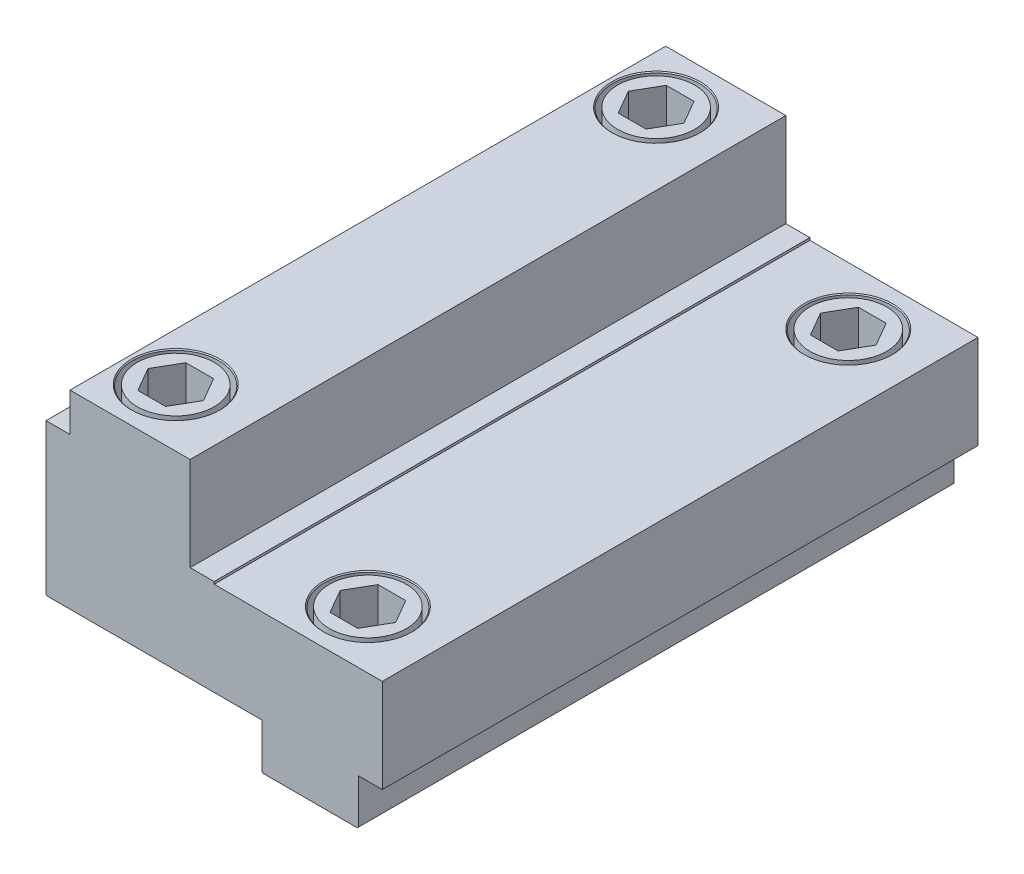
ISO-10303-21;
HEADER;
FILE_DESCRIPTION(('STEP AP214'),'2;1');
FILE_NAME('part.step','',(''),(''),'','','');
FILE_SCHEMA(('AUTOMOTIVE_DESIGN { 1 0 10303 214 1 1 1 1 }'));
ENDSEC;
DATA;
#1=APPLICATION_CONTEXT('core data for automotive mechanical design processes');
#2=APPLICATION_PROTOCOL_DEFINITION('international standard','automotive_design',2000,#1);
#3=PRODUCT_CONTEXT('',#1,'mechanical');
#4=PRODUCT('Part','Part','',(#3));
#5=PRODUCT_RELATED_PRODUCT_CATEGORY('part','',(#4));
#6=PRODUCT_DEFINITION_FORMATION('','',#4);
#7=PRODUCT_DEFINITION_CONTEXT('part definition',#1,'design');
#8=PRODUCT_DEFINITION('design','',#6,#7);
#9=PRODUCT_DEFINITION_SHAPE('','',#8);
#10=(LENGTH_UNIT() NAMED_UNIT(*) SI_UNIT(.MILLI.,.METRE.));
#11=(NAMED_UNIT(*) PLANE_ANGLE_UNIT() SI_UNIT($,.RADIAN.));
#12=(NAMED_UNIT(*) SI_UNIT($,.STERADIAN.) SOLID_ANGLE_UNIT());
#13=UNCERTAINTY_MEASURE_WITH_UNIT(LENGTH_MEASURE(1.E-05),#10,'distance_accuracy_value','');
#14=(GEOMETRIC_REPRESENTATION_CONTEXT(3) GLOBAL_UNCERTAINTY_ASSIGNED_CONTEXT((#13)) GLOBAL_UNIT_ASSIGNED_CONTEXT((#10,
#11,#12)) REPRESENTATION_CONTEXT('',''));
#15=CARTESIAN_POINT('',(0.,0.,0.));
#16=DIRECTION('',(0.,0.,1.));
#17=DIRECTION('',(1.,0.,0.));
#18=AXIS2_PLACEMENT_3D('',#15,#16,#17);
#19=CARTESIAN_POINT('',(55.,-9.5,-12.));
#20=DIRECTION('',(0.,1.,0.));
#21=DIRECTION('',(0.,0.,1.));
#22=AXIS2_PLACEMENT_3D('',#19,#20,#21);
#23=CYLINDRICAL_SURFACE('',#22,5.5);
#24=CARTESIAN_POINT('',(55.,-9.3,-12.));
#25=DIRECTION('',(0.,-1.,0.));
#26=DIRECTION('',(0.,0.,-1.));
#27=AXIS2_PLACEMENT_3D('',#24,#25,#26);
#28=CIRCLE('',#27,5.5);
#29=CARTESIAN_POINT('',(55.,-9.3,-6.5));
#30=VERTEX_POINT('',#29);
#31=EDGE_CURVE('E675',#30,#30,#28,.T.);
#32=CARTESIAN_POINT('',(55.,9.,-12.));
#33=DIRECTION('',(0.,1.,0.));
#34=DIRECTION('',(0.,0.,1.));
#35=AXIS2_PLACEMENT_3D('',#32,#33,#34);
#36=CIRCLE('',#35,5.5);
#37=CARTESIAN_POINT('',(55.,9.,-6.5));
#38=VERTEX_POINT('',#37);
#39=EDGE_CURVE('E12',#38,#38,#36,.F.);
#40=CARTESIAN_POINT('',(55.,-9.3,-6.5));
#41=CARTESIAN_POINT('',(55.,-9.109375,-6.5));
#42=CARTESIAN_POINT('',(55.,-8.91875,-6.5));
#43=CARTESIAN_POINT('',(55.,-8.5375,-6.5));
#44=CARTESIAN_POINT('',(55.,-8.346875,-6.5));
#45=CARTESIAN_POINT('',(55.,-7.965625,-6.5));
#46=CARTESIAN_POINT('',(55.,-7.775,-6.5));
#47=CARTESIAN_POINT('',(55.,-7.39375,-6.5));
#48=CARTESIAN_POINT('',(55.,-7.203125,-6.5));
#49=CARTESIAN_POINT('',(55.,-6.821875,-6.5));
#50=CARTESIAN_POINT('',(55.,-6.63125,-6.5));
#51=CARTESIAN_POINT('',(55.,-6.25,-6.5));
#52=CARTESIAN_POINT('',(55.,-6.059375,-6.5));
#53=CARTESIAN_POINT('',(55.,-5.678125,-6.5));
#54=CARTESIAN_POINT('',(55.,-5.4875,-6.5));
#55=CARTESIAN_POINT('',(55.,-5.10625,-6.5));
#56=CARTESIAN_POINT('',(55.,-4.915625,-6.5));
#57=CARTESIAN_POINT('',(55.,-4.534375,-6.5));
#58=CARTESIAN_POINT('',(55.,-4.34375,-6.5));
#59=CARTESIAN_POINT('',(55.,-3.9625,-6.5));
#60=CARTESIAN_POINT('',(55.,-3.771875,-6.5));
#61=CARTESIAN_POINT('',(55.,-3.390625,-6.5));
#62=CARTESIAN_POINT('',(55.,-3.2,-6.5));
#63=CARTESIAN_POINT('',(55.,-2.81875,-6.5));
#64=CARTESIAN_POINT('',(55.,-2.628125,-6.5));
#65=CARTESIAN_POINT('',(55.,-2.246875,-6.5));
#66=CARTESIAN_POINT('',(55.,-2.05625,-6.5));
#67=CARTESIAN_POINT('',(55.,-1.675,-6.5));
#68=CARTESIAN_POINT('',(55.,-1.484375,-6.5));
#69=CARTESIAN_POINT('',(55.,-1.103125,-6.5));
#70=CARTESIAN_POINT('',(55.,-0.912499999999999,-6.5));
#71=CARTESIAN_POINT('',(55.,-0.531249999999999,-6.5));
#72=CARTESIAN_POINT('',(55.,-0.340624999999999,-6.5));
#73=CARTESIAN_POINT('',(55.,0.0406250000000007,-6.5));
#74=CARTESIAN_POINT('',(55.,0.231250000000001,-6.5));
#75=CARTESIAN_POINT('',(55.,0.612500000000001,-6.5));
#76=CARTESIAN_POINT('',(55.,0.803125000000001,-6.5));
#77=CARTESIAN_POINT('',(55.,1.184375,-6.5));
#78=CARTESIAN_POINT('',(55.,1.375,-6.5));
#79=CARTESIAN_POINT('',(55.,1.75625,-6.5));
#80=CARTESIAN_POINT('',(55.,1.946875,-6.5));
#81=CARTESIAN_POINT('',(55.,2.328125,-6.5));
#82=CARTESIAN_POINT('',(55.,2.51875,-6.5));
#83=CARTESIAN_POINT('',(55.,2.9,-6.5));
#84=CARTESIAN_POINT('',(55.,3.090625,-6.5));
#85=CARTESIAN_POINT('',(55.,3.471875,-6.5));
#86=CARTESIAN_POINT('',(55.,3.6625,-6.5));
#87=CARTESIAN_POINT('',(55.,4.04375,-6.5));
#88=CARTESIAN_POINT('',(55.,4.234375,-6.5));
#89=CARTESIAN_POINT('',(55.,4.615625,-6.5));
#90=CARTESIAN_POINT('',(55.,4.80625,-6.5));
#91=CARTESIAN_POINT('',(55.,5.1875,-6.5));
#92=CARTESIAN_POINT('',(55.,5.378125,-6.5));
#93=CARTESIAN_POINT('',(55.,5.759375,-6.5));
#94=CARTESIAN_POINT('',(55.,5.95,-6.5));
#95=CARTESIAN_POINT('',(55.,6.33125,-6.5));
#96=CARTESIAN_POINT('',(55.,6.521875,-6.5));
#97=CARTESIAN_POINT('',(55.,6.903125,-6.5));
#98=CARTESIAN_POINT('',(55.,7.09375,-6.5));
#99=CARTESIAN_POINT('',(55.,7.475,-6.5));
#100=CARTESIAN_POINT('',(55.,7.665625,-6.5));
#101=CARTESIAN_POINT('',(55.,8.046875,-6.5));
#102=CARTESIAN_POINT('',(55.,8.2375,-6.5));
#103=CARTESIAN_POINT('',(55.,8.61875,-6.5));
#104=CARTESIAN_POINT('',(55.,8.809375,-6.5));
#105=CARTESIAN_POINT('',(55.,9.,-6.5));
#106=B_SPLINE_CURVE_WITH_KNOTS('',3,(#40,#41,#42,#43,#44,#45,#46,#47,#48,#49,#50,#51,#52,#53,
#54,#55,#56,#57,#58,#59,#60,#61,#62,#63,#64,#65,#66,#67,#68,#69,#70,#71,#72,#73,#74,#75,#76,#77,
#78,#79,#80,#81,#82,#83,#84,#85,#86,#87,#88,#89,#90,#91,#92,#93,#94,#95,#96,#97,#98,#99,#100,
#101,#102,#103,#104,#105),.UNSPECIFIED.,.F.,.F.,(4,2,2,2,2,2,2,2,2,2,2,2,2,2,2,2,2,2,2,2,2,2,2,
2,2,2,2,2,2,2,2,2,4),(0.,0.571874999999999,1.14375,1.715625,2.2875,2.859375,3.43125,4.003125,
4.575,5.146875,5.71875,6.290625,6.8625,7.434375,8.00625,8.578125,9.15,9.721875,10.29375,
10.865625,11.4375,12.009375,12.58125,13.153125,13.725,14.296875,14.86875,15.440625,16.0125,
16.584375,17.15625,17.728125,18.3),.UNSPECIFIED.);
#107=EDGE_CURVE('BSEAM79',#30,#38,#106,.T.);
#108=ORIENTED_EDGE('',*,*,#31,.T.);
#109=ORIENTED_EDGE('',*,*,#39,.F.);
#110=ORIENTED_EDGE('',*,*,#107,.T.);
#111=ORIENTED_EDGE('',*,*,#107,.F.);
#112=EDGE_LOOP('',(#108,#110,#109,#111));
#113=FACE_BOUND('',#112,.T.);
#114=ADVANCED_FACE('F79',(#113),#23,.F.);
#115=CARTESIAN_POINT('',(55.,-9.5,-112.));
#116=DIRECTION('',(0.,1.,0.));
#117=DIRECTION('',(0.,0.,1.));
#118=AXIS2_PLACEMENT_3D('',#115,#116,#117);
#119=CYLINDRICAL_SURFACE('',#118,5.5);
#120=CARTESIAN_POINT('',(55.,-9.30000000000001,-112.));
#121=DIRECTION('',(0.,-1.,0.));
#122=DIRECTION('',(0.,0.,-1.));
#123=AXIS2_PLACEMENT_3D('',#120,#121,#122);
#124=CIRCLE('',#123,5.5);
#125=CARTESIAN_POINT('',(55.,-9.3,-106.5));
#126=VERTEX_POINT('',#125);
#127=EDGE_CURVE('E672',#126,#126,#124,.T.);
#128=CARTESIAN_POINT('',(55.,9.,-112.));
#129=DIRECTION('',(0.,1.,0.));
#130=DIRECTION('',(0.,0.,1.));
#131=AXIS2_PLACEMENT_3D('',#128,#129,#130);
#132=CIRCLE('',#131,5.5);
#133=CARTESIAN_POINT('',(55.,9.,-106.5));
#134=VERTEX_POINT('',#133);
#135=EDGE_CURVE('E87',#134,#134,#132,.F.);
#136=CARTESIAN_POINT('',(55.,-9.3,-106.5));
#137=CARTESIAN_POINT('',(55.,-9.10937500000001,-106.5));
#138=CARTESIAN_POINT('',(55.,-8.91875,-106.5));
#139=CARTESIAN_POINT('',(55.,-8.5375,-106.5));
#140=CARTESIAN_POINT('',(55.,-8.34687500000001,-106.5));
#141=CARTESIAN_POINT('',(55.,-7.96562500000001,-106.5));
#142=CARTESIAN_POINT('',(55.,-7.775,-106.5));
#143=CARTESIAN_POINT('',(55.,-7.39375000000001,-106.5));
#144=CARTESIAN_POINT('',(55.,-7.203125,-106.5));
#145=CARTESIAN_POINT('',(55.,-6.821875,-106.5));
#146=CARTESIAN_POINT('',(55.,-6.63125,-106.5));
#147=CARTESIAN_POINT('',(55.,-6.25,-106.5));
#148=CARTESIAN_POINT('',(55.,-6.059375,-106.5));
#149=CARTESIAN_POINT('',(55.,-5.678125,-106.5));
#150=CARTESIAN_POINT('',(55.,-5.4875,-106.5));
#151=CARTESIAN_POINT('',(55.,-5.10625,-106.5));
#152=CARTESIAN_POINT('',(55.,-4.915625,-106.5));
#153=CARTESIAN_POINT('',(55.,-4.534375,-106.5));
#154=CARTESIAN_POINT('',(55.,-4.34375,-106.5));
#155=CARTESIAN_POINT('',(55.,-3.9625,-106.5));
#156=CARTESIAN_POINT('',(55.,-3.771875,-106.5));
#157=CARTESIAN_POINT('',(55.,-3.390625,-106.5));
#158=CARTESIAN_POINT('',(55.,-3.2,-106.5));
#159=CARTESIAN_POINT('',(55.,-2.81875,-106.5));
#160=CARTESIAN_POINT('',(55.,-2.628125,-106.5));
#161=CARTESIAN_POINT('',(55.,-2.246875,-106.5));
#162=CARTESIAN_POINT('',(55.,-2.05625,-106.5));
#163=CARTESIAN_POINT('',(55.,-1.675,-106.5));
#164=CARTESIAN_POINT('',(55.,-1.484375,-106.5));
#165=CARTESIAN_POINT('',(55.,-1.103125,-106.5));
#166=CARTESIAN_POINT('',(55.,-0.912500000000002,-106.5));
#167=CARTESIAN_POINT('',(55.,-0.531250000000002,-106.5));
#168=CARTESIAN_POINT('',(55.,-0.340625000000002,-106.5));
#169=CARTESIAN_POINT('',(55.,0.0406249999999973,-106.5));
#170=CARTESIAN_POINT('',(55.,0.231249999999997,-106.5));
#171=CARTESIAN_POINT('',(55.,0.612499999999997,-106.5));
#172=CARTESIAN_POINT('',(55.,0.803124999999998,-106.5));
#173=CARTESIAN_POINT('',(55.,1.184375,-106.5));
#174=CARTESIAN_POINT('',(55.,1.375,-106.5));
#175=CARTESIAN_POINT('',(55.,1.75625,-106.5));
#176=CARTESIAN_POINT('',(55.,1.946875,-106.5));
#177=CARTESIAN_POINT('',(55.,2.328125,-106.5));
#178=CARTESIAN_POINT('',(55.,2.51875,-106.5));
#179=CARTESIAN_POINT('',(55.,2.9,-106.5));
#180=CARTESIAN_POINT('',(55.,3.090625,-106.5));
#181=CARTESIAN_POINT('',(55.,3.471875,-106.5));
#182=CARTESIAN_POINT('',(55.,3.6625,-106.5));
#183=CARTESIAN_POINT('',(55.,4.04375,-106.5));
#184=CARTESIAN_POINT('',(55.,4.234375,-106.5));
#185=CARTESIAN_POINT('',(55.,4.615625,-106.5));
#186=CARTESIAN_POINT('',(55.,4.80625,-106.5));
#187=CARTESIAN_POINT('',(55.,5.1875,-106.5));
#188=CARTESIAN_POINT('',(55.,5.378125,-106.5));
#189=CARTESIAN_POINT('',(55.,5.759375,-106.5));
#190=CARTESIAN_POINT('',(55.,5.95,-106.5));
#191=CARTESIAN_POINT('',(55.,6.33125,-106.5));
#192=CARTESIAN_POINT('',(55.,6.521875,-106.5));
#193=CARTESIAN_POINT('',(55.,6.903125,-106.5));
#194=CARTESIAN_POINT('',(55.,7.09375,-106.5));
#195=CARTESIAN_POINT('',(55.,7.475,-106.5));
#196=CARTESIAN_POINT('',(55.,7.665625,-106.5));
#197=CARTESIAN_POINT('',(55.,8.046875,-106.5));
#198=CARTESIAN_POINT('',(55.,8.2375,-106.5));
#199=CARTESIAN_POINT('',(55.,8.61875,-106.5));
#200=CARTESIAN_POINT('',(55.,8.809375,-106.5));
#201=CARTESIAN_POINT('',(55.,9.,-106.5));
#202=B_SPLINE_CURVE_WITH_KNOTS('',3,(#136,#137,#138,#139,#140,#141,#142,#143,#144,#145,#146,
#147,#148,#149,#150,#151,#152,#153,#154,#155,#156,#157,#158,#159,#160,#161,#162,#163,#164,#165,
#166,#167,#168,#169,#170,#171,#172,#173,#174,#175,#176,#177,#178,#179,#180,#181,#182,#183,#184,
#185,#186,#187,#188,#189,#190,#191,#192,#193,#194,#195,#196,#197,#198,#199,#200,#201),
.UNSPECIFIED.,.F.,.F.,(4,2,2,2,2,2,2,2,2,2,2,2,2,2,2,2,2,2,2,2,2,2,2,2,2,2,2,2,2,2,2,2,4),(0.,
0.571874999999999,1.14375,1.715625,2.2875,2.859375,3.43125,4.003125,4.575,5.146875,5.71875,
6.290625,6.8625,7.434375,8.00625,8.578125,9.15,9.721875,10.29375,10.865625,11.4375,12.009375,
12.58125,13.153125,13.725,14.296875,14.86875,15.440625,16.0125,16.584375,17.15625,17.728125,
18.3),.UNSPECIFIED.);
#203=EDGE_CURVE('BSEAM742',#126,#134,#202,.T.);
#204=ORIENTED_EDGE('',*,*,#127,.T.);
#205=ORIENTED_EDGE('',*,*,#135,.F.);
#206=ORIENTED_EDGE('',*,*,#203,.T.);
#207=ORIENTED_EDGE('',*,*,#203,.F.);
#208=EDGE_LOOP('',(#204,#206,#205,#207));
#209=FACE_BOUND('',#208,.T.);
#210=ADVANCED_FACE('F742',(#209),#119,.F.);
#211=CARTESIAN_POINT('',(15.,-9.5,-12.));
#212=DIRECTION('',(0.,1.,0.));
#213=DIRECTION('',(0.,0.,1.));
#214=AXIS2_PLACEMENT_3D('',#211,#212,#213);
#215=CYLINDRICAL_SURFACE('',#214,5.5);
#216=CARTESIAN_POINT('',(15.,0.199999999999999,-12.));
#217=DIRECTION('',(0.,-1.,0.));
#218=DIRECTION('',(0.,0.,-1.));
#219=AXIS2_PLACEMENT_3D('',#216,#217,#218);
#220=CIRCLE('',#219,5.5);
#221=CARTESIAN_POINT('',(15.,0.200000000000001,-6.5));
#222=VERTEX_POINT('',#221);
#223=EDGE_CURVE('E678',#222,#222,#220,.T.);
#224=CARTESIAN_POINT('',(15.,28.5,-12.));
#225=DIRECTION('',(0.,1.,0.));
#226=DIRECTION('',(0.,0.,1.));
#227=AXIS2_PLACEMENT_3D('',#224,#225,#226);
#228=CIRCLE('',#227,5.5);
#229=CARTESIAN_POINT('',(15.,28.5,-6.5));
#230=VERTEX_POINT('',#229);
#231=EDGE_CURVE('E735',#230,#230,#228,.F.);
#232=CARTESIAN_POINT('',(15.,0.200000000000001,-6.5));
#233=CARTESIAN_POINT('',(15.,0.494791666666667,-6.5));
#234=CARTESIAN_POINT('',(15.,0.789583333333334,-6.5));
#235=CARTESIAN_POINT('',(15.,1.37916666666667,-6.5));
#236=CARTESIAN_POINT('',(15.,1.67395833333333,-6.5));
#237=CARTESIAN_POINT('',(15.,2.26354166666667,-6.5));
#238=CARTESIAN_POINT('',(15.,2.55833333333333,-6.5));
#239=CARTESIAN_POINT('',(15.,3.14791666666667,-6.5));
#240=CARTESIAN_POINT('',(15.,3.44270833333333,-6.5));
#241=CARTESIAN_POINT('',(15.,4.03229166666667,-6.5));
#242=CARTESIAN_POINT('',(15.,4.32708333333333,-6.5));
#243=CARTESIAN_POINT('',(15.,4.91666666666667,-6.5));
#244=CARTESIAN_POINT('',(15.,5.21145833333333,-6.5));
#245=CARTESIAN_POINT('',(15.,5.80104166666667,-6.5));
#246=CARTESIAN_POINT('',(15.,6.09583333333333,-6.5));
#247=CARTESIAN_POINT('',(15.,6.68541666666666,-6.5));
#248=CARTESIAN_POINT('',(15.,6.98020833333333,-6.5));
#249=CARTESIAN_POINT('',(15.,7.56979166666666,-6.5));
#250=CARTESIAN_POINT('',(15.,7.86458333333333,-6.5));
#251=CARTESIAN_POINT('',(15.,8.45416666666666,-6.5));
#252=CARTESIAN_POINT('',(15.,8.74895833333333,-6.5));
#253=CARTESIAN_POINT('',(15.,9.33854166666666,-6.5));
#254=CARTESIAN_POINT('',(15.,9.63333333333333,-6.5));
#255=CARTESIAN_POINT('',(15.,10.2229166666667,-6.5));
#256=CARTESIAN_POINT('',(15.,10.5177083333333,-6.5));
#257=CARTESIAN_POINT('',(15.,11.1072916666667,-6.5));
#258=CARTESIAN_POINT('',(15.,11.4020833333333,-6.5));
#259=CARTESIAN_POINT('',(15.,11.9916666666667,-6.5));
#260=CARTESIAN_POINT('',(15.,12.2864583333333,-6.5));
#261=CARTESIAN_POINT('',(15.,12.8760416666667,-6.5));
#262=CARTESIAN_POINT('',(15.,13.1708333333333,-6.5));
#263=CARTESIAN_POINT('',(15.,13.7604166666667,-6.5));
#264=CARTESIAN_POINT('',(15.,14.0552083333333,-6.5));
#265=CARTESIAN_POINT('',(15.,14.6447916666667,-6.5));
#266=CARTESIAN_POINT('',(15.,14.9395833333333,-6.5));
#267=CARTESIAN_POINT('',(15.,15.5291666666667,-6.5));
#268=CARTESIAN_POINT('',(15.,15.8239583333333,-6.5));
#269=CARTESIAN_POINT('',(15.,16.4135416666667,-6.5));
#270=CARTESIAN_POINT('',(15.,16.7083333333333,-6.5));
#271=CARTESIAN_POINT('',(15.,17.2979166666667,-6.5));
#272=CARTESIAN_POINT('',(15.,17.5927083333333,-6.5));
#273=CARTESIAN_POINT('',(15.,18.1822916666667,-6.5));
#274=CARTESIAN_POINT('',(15.,18.4770833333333,-6.5));
#275=CARTESIAN_POINT('',(15.,19.0666666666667,-6.5));
#276=CARTESIAN_POINT('',(15.,19.3614583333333,-6.5));
#277=CARTESIAN_POINT('',(15.,19.9510416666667,-6.5));
#278=CARTESIAN_POINT('',(15.,20.2458333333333,-6.5));
#279=CARTESIAN_POINT('',(15.,20.8354166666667,-6.5));
#280=CARTESIAN_POINT('',(15.,21.1302083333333,-6.5));
#281=CARTESIAN_POINT('',(15.,21.7197916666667,-6.5));
#282=CARTESIAN_POINT('',(15.,22.0145833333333,-6.5));
#283=CARTESIAN_POINT('',(15.,22.6041666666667,-6.5));
#284=CARTESIAN_POINT('',(15.,22.8989583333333,-6.5));
#285=CARTESIAN_POINT('',(15.,23.4885416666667,-6.5));
#286=CARTESIAN_POINT('',(15.,23.7833333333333,-6.5));
#287=CARTESIAN_POINT('',(15.,24.3729166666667,-6.5));
#288=CARTESIAN_POINT('',(15.,24.6677083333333,-6.5));
#289=CARTESIAN_POINT('',(15.,25.2572916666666,-6.5));
#290=CARTESIAN_POINT('',(15.,25.5520833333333,-6.5));
#291=CARTESIAN_POINT('',(15.,26.1416666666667,-6.5));
#292=CARTESIAN_POINT('',(15.,26.4364583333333,-6.5));
#293=CARTESIAN_POINT('',(15.,27.0260416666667,-6.5));
#294=CARTESIAN_POINT('',(15.,27.3208333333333,-6.5));
#295=CARTESIAN_POINT('',(15.,27.9104166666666,-6.5));
#296=CARTESIAN_POINT('',(15.,28.2052083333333,-6.5));
#297=CARTESIAN_POINT('',(15.,28.5,-6.5));
#298=B_SPLINE_CURVE_WITH_KNOTS('',3,(#232,#233,#234,#235,#236,#237,#238,#239,#240,#241,#242,
#243,#244,#245,#246,#247,#248,#249,#250,#251,#252,#253,#254,#255,#256,#257,#258,#259,#260,#261,
#262,#263,#264,#265,#266,#267,#268,#269,#270,#271,#272,#273,#274,#275,#276,#277,#278,#279,#280,
#281,#282,#283,#284,#285,#286,#287,#288,#289,#290,#291,#292,#293,#294,#295,#296,#297),
.UNSPECIFIED.,.F.,.F.,(4,2,2,2,2,2,2,2,2,2,2,2,2,2,2,2,2,2,2,2,2,2,2,2,2,2,2,2,2,2,2,2,4),(0.,
0.884375,1.76875,2.653125,3.5375,4.421875,5.30625,6.190625,7.075,7.95937499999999,
8.84374999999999,9.72812499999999,10.6125,11.496875,12.38125,13.265625,14.15,15.034375,15.91875,
16.803125,17.6875,18.571875,19.45625,20.340625,21.225,22.109375,22.99375,23.878125,24.7625,
25.646875,26.53125,27.415625,28.3),.UNSPECIFIED.);
#299=EDGE_CURVE('BSEAM744',#222,#230,#298,.T.);
#300=ORIENTED_EDGE('',*,*,#223,.T.);
#301=ORIENTED_EDGE('',*,*,#231,.F.);
#302=ORIENTED_EDGE('',*,*,#299,.T.);
#303=ORIENTED_EDGE('',*,*,#299,.F.);
#304=EDGE_LOOP('',(#300,#302,#301,#303));
#305=FACE_BOUND('',#304,.T.);
#306=ADVANCED_FACE('F744',(#305),#215,.F.);
#307=CARTESIAN_POINT('',(15.,-9.5,-112.));
#308=DIRECTION('',(0.,1.,0.));
#309=DIRECTION('',(0.,0.,1.));
#310=AXIS2_PLACEMENT_3D('',#307,#308,#309);
#311=CYLINDRICAL_SURFACE('',#310,5.5);
#312=CARTESIAN_POINT('',(15.,0.199999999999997,-112.));
#313=DIRECTION('',(0.,-1.,0.));
#314=DIRECTION('',(0.,0.,-1.));
#315=AXIS2_PLACEMENT_3D('',#312,#313,#314);
#316=CIRCLE('',#315,5.5);
#317=CARTESIAN_POINT('',(15.,0.199999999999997,-106.5));
#318=VERTEX_POINT('',#317);
#319=EDGE_CURVE('E669',#318,#318,#316,.T.);
#320=CARTESIAN_POINT('',(15.,28.5,-112.));
#321=DIRECTION('',(0.,1.,0.));
#322=DIRECTION('',(0.,0.,1.));
#323=AXIS2_PLACEMENT_3D('',#320,#321,#322);
#324=CIRCLE('',#323,5.5);
#325=CARTESIAN_POINT('',(15.,28.5,-106.5));
#326=VERTEX_POINT('',#325);
#327=EDGE_CURVE('E732',#326,#326,#324,.F.);
#328=CARTESIAN_POINT('',(15.,0.199999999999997,-106.5));
#329=CARTESIAN_POINT('',(15.,0.494791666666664,-106.5));
#330=CARTESIAN_POINT('',(15.,0.78958333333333,-106.5));
#331=CARTESIAN_POINT('',(15.,1.37916666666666,-106.5));
#332=CARTESIAN_POINT('',(15.,1.67395833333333,-106.5));
#333=CARTESIAN_POINT('',(15.,2.26354166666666,-106.5));
#334=CARTESIAN_POINT('',(15.,2.55833333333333,-106.5));
#335=CARTESIAN_POINT('',(15.,3.14791666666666,-106.5));
#336=CARTESIAN_POINT('',(15.,3.44270833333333,-106.5));
#337=CARTESIAN_POINT('',(15.,4.03229166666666,-106.5));
#338=CARTESIAN_POINT('',(15.,4.32708333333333,-106.5));
#339=CARTESIAN_POINT('',(15.,4.91666666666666,-106.5));
#340=CARTESIAN_POINT('',(15.,5.21145833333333,-106.5));
#341=CARTESIAN_POINT('',(15.,5.80104166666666,-106.5));
#342=CARTESIAN_POINT('',(15.,6.09583333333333,-106.5));
#343=CARTESIAN_POINT('',(15.,6.68541666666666,-106.5));
#344=CARTESIAN_POINT('',(15.,6.98020833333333,-106.5));
#345=CARTESIAN_POINT('',(15.,7.56979166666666,-106.5));
#346=CARTESIAN_POINT('',(15.,7.86458333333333,-106.5));
#347=CARTESIAN_POINT('',(15.,8.45416666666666,-106.5));
#348=CARTESIAN_POINT('',(15.,8.74895833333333,-106.5));
#349=CARTESIAN_POINT('',(15.,9.33854166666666,-106.5));
#350=CARTESIAN_POINT('',(15.,9.63333333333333,-106.5));
#351=CARTESIAN_POINT('',(15.,10.2229166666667,-106.5));
#352=CARTESIAN_POINT('',(15.,10.5177083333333,-106.5));
#353=CARTESIAN_POINT('',(15.,11.1072916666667,-106.5));
#354=CARTESIAN_POINT('',(15.,11.4020833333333,-106.5));
#355=CARTESIAN_POINT('',(15.,11.9916666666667,-106.5));
#356=CARTESIAN_POINT('',(15.,12.2864583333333,-106.5));
#357=CARTESIAN_POINT('',(15.,12.8760416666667,-106.5));
#358=CARTESIAN_POINT('',(15.,13.1708333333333,-106.5));
#359=CARTESIAN_POINT('',(15.,13.7604166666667,-106.5));
#360=CARTESIAN_POINT('',(15.,14.0552083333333,-106.5));
#361=CARTESIAN_POINT('',(15.,14.6447916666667,-106.5));
#362=CARTESIAN_POINT('',(15.,14.9395833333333,-106.5));
#363=CARTESIAN_POINT('',(15.,15.5291666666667,-106.5));
#364=CARTESIAN_POINT('',(15.,15.8239583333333,-106.5));
#365=CARTESIAN_POINT('',(15.,16.4135416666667,-106.5));
#366=CARTESIAN_POINT('',(15.,16.7083333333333,-106.5));
#367=CARTESIAN_POINT('',(15.,17.2979166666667,-106.5));
#368=CARTESIAN_POINT('',(15.,17.5927083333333,-106.5));
#369=CARTESIAN_POINT('',(15.,18.1822916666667,-106.5));
#370=CARTESIAN_POINT('',(15.,18.4770833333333,-106.5));
#371=CARTESIAN_POINT('',(15.,19.0666666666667,-106.5));
#372=CARTESIAN_POINT('',(15.,19.3614583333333,-106.5));
#373=CARTESIAN_POINT('',(15.,19.9510416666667,-106.5));
#374=CARTESIAN_POINT('',(15.,20.2458333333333,-106.5));
#375=CARTESIAN_POINT('',(15.,20.8354166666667,-106.5));
#376=CARTESIAN_POINT('',(15.,21.1302083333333,-106.5));
#377=CARTESIAN_POINT('',(15.,21.7197916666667,-106.5));
#378=CARTESIAN_POINT('',(15.,22.0145833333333,-106.5));
#379=CARTESIAN_POINT('',(15.,22.6041666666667,-106.5));
#380=CARTESIAN_POINT('',(15.,22.8989583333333,-106.5));
#381=CARTESIAN_POINT('',(15.,23.4885416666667,-106.5));
#382=CARTESIAN_POINT('',(15.,23.7833333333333,-106.5));
#383=CARTESIAN_POINT('',(15.,24.3729166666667,-106.5));
#384=CARTESIAN_POINT('',(15.,24.6677083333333,-106.5));
#385=CARTESIAN_POINT('',(15.,25.2572916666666,-106.5));
#386=CARTESIAN_POINT('',(15.,25.5520833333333,-106.5));
#387=CARTESIAN_POINT('',(15.,26.1416666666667,-106.5));
#388=CARTESIAN_POINT('',(15.,26.4364583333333,-106.5));
#389=CARTESIAN_POINT('',(15.,27.0260416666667,-106.5));
#390=CARTESIAN_POINT('',(15.,27.3208333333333,-106.5));
#391=CARTESIAN_POINT('',(15.,27.9104166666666,-106.5));
#392=CARTESIAN_POINT('',(15.,28.2052083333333,-106.5));
#393=CARTESIAN_POINT('',(15.,28.5,-106.5));
#394=B_SPLINE_CURVE_WITH_KNOTS('',3,(#328,#329,#330,#331,#332,#333,#334,#335,#336,#337,#338,
#339,#340,#341,#342,#343,#344,#345,#346,#347,#348,#349,#350,#351,#352,#353,#354,#355,#356,#357,
#358,#359,#360,#361,#362,#363,#364,#365,#366,#367,#368,#369,#370,#371,#372,#373,#374,#375,#376,
#377,#378,#379,#380,#381,#382,#383,#384,#385,#386,#387,#388,#389,#390,#391,#392,#393),
.UNSPECIFIED.,.F.,.F.,(4,2,2,2,2,2,2,2,2,2,2,2,2,2,2,2,2,2,2,2,2,2,2,2,2,2,2,2,2,2,2,2,4),(0.,
0.884375,1.76875,2.653125,3.5375,4.421875,5.30625,6.190625,7.075,7.959375,8.84375,9.728125,
10.6125,11.496875,12.38125,13.265625,14.15,15.034375,15.91875,16.803125,17.6875,18.571875,
19.45625,20.340625,21.225,22.109375,22.99375,23.878125,24.7625,25.646875,26.53125,27.415625,
28.3),.UNSPECIFIED.);
#395=EDGE_CURVE('BSEAM751',#318,#326,#394,.T.);
#396=ORIENTED_EDGE('',*,*,#319,.T.);
#397=ORIENTED_EDGE('',*,*,#327,.F.);
#398=ORIENTED_EDGE('',*,*,#395,.T.);
#399=ORIENTED_EDGE('',*,*,#395,.F.);
#400=EDGE_LOOP('',(#396,#398,#397,#399));
#401=FACE_BOUND('',#400,.T.);
#402=ADVANCED_FACE('F751',(#401),#311,.F.);
#403=CARTESIAN_POINT('',(55.,10.,-12.));
#404=DIRECTION('',(0.,1.,0.));
#405=DIRECTION('',(0.,0.,1.));
#406=AXIS2_PLACEMENT_3D('',#403,#404,#405);
#407=PLANE('',#406);
#408=CARTESIAN_POINT('',(55.,10.,-12.));
#409=DIRECTION('',(0.,1.,0.));
#410=DIRECTION('',(0.,0.,1.));
#411=AXIS2_PLACEMENT_3D('',#408,#409,#410);
#412=CIRCLE('',#411,9.);
#413=CARTESIAN_POINT('',(55.,10.,-3.));
#414=VERTEX_POINT('',#413);
#415=EDGE_CURVE('E566',#414,#414,#412,.T.);
#416=ORIENTED_EDGE('',*,*,#415,.T.);
#417=EDGE_LOOP('',(#416));
#418=FACE_BOUND('',#417,.T.);
#419=CARTESIAN_POINT('',(55.,10.,-12.));
#420=DIRECTION('',(0.,1.,0.));
#421=DIRECTION('',(0.,0.,1.));
#422=AXIS2_PLACEMENT_3D('',#419,#420,#421);
#423=CIRCLE('',#422,8.00000000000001);
#424=CARTESIAN_POINT('',(55.,10.,-3.99999999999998));
#425=VERTEX_POINT('',#424);
#426=EDGE_CURVE('E353',#425,#425,#423,.T.);
#427=ORIENTED_EDGE('',*,*,#426,.F.);
#428=EDGE_LOOP('',(#427));
#429=FACE_BOUND('',#428,.T.);
#430=ADVANCED_FACE('F944',(#418,#429),#407,.T.);
#431=CARTESIAN_POINT('',(55.,10.,-112.));
#432=DIRECTION('',(0.,1.,0.));
#433=DIRECTION('',(0.,0.,1.));
#434=AXIS2_PLACEMENT_3D('',#431,#432,#433);
#435=PLANE('',#434);
#436=CARTESIAN_POINT('',(55.,10.,-112.));
#437=DIRECTION('',(0.,1.,0.));
#438=DIRECTION('',(0.,0.,1.));
#439=AXIS2_PLACEMENT_3D('',#436,#437,#438);
#440=CIRCLE('',#439,8.99999999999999);
#441=CARTESIAN_POINT('',(55.,10.,-103.));
#442=VERTEX_POINT('',#441);
#443=EDGE_CURVE('E569',#442,#442,#440,.T.);
#444=ORIENTED_EDGE('',*,*,#443,.T.);
#445=EDGE_LOOP('',(#444));
#446=FACE_BOUND('',#445,.T.);
#447=CARTESIAN_POINT('',(55.,10.,-112.));
#448=DIRECTION('',(0.,1.,0.));
#449=DIRECTION('',(0.,0.,1.));
#450=AXIS2_PLACEMENT_3D('',#447,#448,#449);
#451=CIRCLE('',#450,8.00000000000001);
#452=CARTESIAN_POINT('',(55.,10.,-104.));
#453=VERTEX_POINT('',#452);
#454=EDGE_CURVE('E432',#453,#453,#451,.T.);
#455=ORIENTED_EDGE('',*,*,#454,.F.);
#456=EDGE_LOOP('',(#455));
#457=FACE_BOUND('',#456,.T.);
#458=ADVANCED_FACE('F951',(#446,#457),#435,.T.);
#459=CARTESIAN_POINT('',(15.,29.5,-12.));
#460=DIRECTION('',(0.,1.,0.));
#461=DIRECTION('',(0.,0.,1.));
#462=AXIS2_PLACEMENT_3D('',#459,#460,#461);
#463=PLANE('',#462);
#464=CARTESIAN_POINT('',(15.,29.5,-12.));
#465=DIRECTION('',(0.,1.,0.));
#466=DIRECTION('',(0.,0.,1.));
#467=AXIS2_PLACEMENT_3D('',#464,#465,#466);
#468=CIRCLE('',#467,9.);
#469=CARTESIAN_POINT('',(15.,29.5,-3.));
#470=VERTEX_POINT('',#469);
#471=EDGE_CURVE('E559',#470,#470,#468,.T.);
#472=ORIENTED_EDGE('',*,*,#471,.T.);
#473=EDGE_LOOP('',(#472));
#474=FACE_BOUND('',#473,.T.);
#475=CARTESIAN_POINT('',(15.,29.5,-12.));
#476=DIRECTION('',(0.,1.,0.));
#477=DIRECTION('',(0.,0.,1.));
#478=AXIS2_PLACEMENT_3D('',#475,#476,#477);
#479=CIRCLE('',#478,8.00000000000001);
#480=CARTESIAN_POINT('',(15.,29.5,-3.99999999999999));
#481=VERTEX_POINT('',#480);
#482=EDGE_CURVE('E440',#481,#481,#479,.T.);
#483=ORIENTED_EDGE('',*,*,#482,.F.);
#484=EDGE_LOOP('',(#483));
#485=FACE_BOUND('',#484,.T.);
#486=ADVANCED_FACE('F930',(#474,#485),#463,.T.);
#487=CARTESIAN_POINT('',(15.,29.5,-112.));
#488=DIRECTION('',(0.,1.,0.));
#489=DIRECTION('',(0.,0.,1.));
#490=AXIS2_PLACEMENT_3D('',#487,#488,#489);
#491=PLANE('',#490);
#492=CARTESIAN_POINT('',(15.,29.5,-112.));
#493=DIRECTION('',(0.,1.,0.));
#494=DIRECTION('',(0.,0.,1.));
#495=AXIS2_PLACEMENT_3D('',#492,#493,#494);
#496=CIRCLE('',#495,9.00000000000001);
#497=CARTESIAN_POINT('',(15.,29.5,-103.));
#498=VERTEX_POINT('',#497);
#499=EDGE_CURVE('E563',#498,#498,#496,.T.);
#500=ORIENTED_EDGE('',*,*,#499,.T.);
#501=EDGE_LOOP('',(#500));
#502=FACE_BOUND('',#501,.T.);
#503=CARTESIAN_POINT('',(15.,29.5,-112.));
#504=DIRECTION('',(0.,1.,0.));
#505=DIRECTION('',(0.,0.,1.));
#506=AXIS2_PLACEMENT_3D('',#503,#504,#505);
#507=CIRCLE('',#506,8.00000000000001);
#508=CARTESIAN_POINT('',(15.,29.5,-104.));
#509=VERTEX_POINT('',#508);
#510=EDGE_CURVE('E540',#509,#509,#507,.T.);
#511=ORIENTED_EDGE('',*,*,#510,.F.);
#512=EDGE_LOOP('',(#511));
#513=FACE_BOUND('',#512,.T.);
#514=ADVANCED_FACE('F798',(#502,#513),#491,.T.);
#515=CARTESIAN_POINT('',(70.,20.,-124.));
#516=DIRECTION('',(1.,0.,0.));
#517=DIRECTION('',(0.,0.,-1.));
#518=AXIS2_PLACEMENT_3D('',#515,#516,#517);
#519=PLANE('',#518);
#520=DIRECTION('',(0.,1.,0.));
#521=VECTOR('',#520,1.);
#522=CARTESIAN_POINT('',(70.,20.,-124.));
#523=LINE('',#522,#521);
#524=CARTESIAN_POINT('',(70.,0.,-124.));
#525=VERTEX_POINT('',#524);
#526=CARTESIAN_POINT('',(70.,19.5,-124.));
#527=VERTEX_POINT('',#526);
#528=EDGE_CURVE('E587',#525,#527,#523,.T.);
#529=ORIENTED_EDGE('',*,*,#528,.T.);
#530=DIRECTION('',(0.,0.,-1.));
#531=VECTOR('',#530,1.);
#532=CARTESIAN_POINT('',(70.,19.5,0.));
#533=LINE('',#532,#531);
#534=CARTESIAN_POINT('',(70.,19.5,0.));
#535=VERTEX_POINT('',#534);
#536=EDGE_CURVE('E545',#535,#527,#533,.T.);
#537=ORIENTED_EDGE('',*,*,#536,.F.);
#538=DIRECTION('',(0.,1.,0.));
#539=VECTOR('',#538,1.);
#540=CARTESIAN_POINT('',(70.,20.,0.));
#541=LINE('',#540,#539);
#542=CARTESIAN_POINT('',(70.,0.,0.));
#543=VERTEX_POINT('',#542);
#544=EDGE_CURVE('E620',#543,#535,#541,.T.);
#545=ORIENTED_EDGE('',*,*,#544,.F.);
#546=DIRECTION('',(0.,0.,1.));
#547=VECTOR('',#546,1.);
#548=CARTESIAN_POINT('',(70.,0.,-124.));
#549=LINE('',#548,#547);
#550=EDGE_CURVE('E651',#525,#543,#549,.T.);
#551=ORIENTED_EDGE('',*,*,#550,.F.);
#552=EDGE_LOOP('',(#529,#537,#545,#551));
#553=FACE_BOUND('',#552,.T.);
#554=ADVANCED_FACE('F794',(#553),#519,.T.);
#555=CARTESIAN_POINT('',(55.,10.,-112.));
#556=DIRECTION('',(0.,1.,0.));
#557=DIRECTION('',(0.,0.,1.));
#558=AXIS2_PLACEMENT_3D('',#555,#556,#557);
#559=CYLINDRICAL_SURFACE('',#558,8.99999999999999);
#560=CARTESIAN_POINT('',(55.,19.3,-112.));
#561=DIRECTION('',(0.,1.,0.));
#562=DIRECTION('',(0.,0.,1.));
#563=AXIS2_PLACEMENT_3D('',#560,#561,#562);
#564=CIRCLE('',#563,8.99999999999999);
#565=CARTESIAN_POINT('',(55.,19.3,-103.));
#566=VERTEX_POINT('',#565);
#567=EDGE_CURVE('E726',#566,#566,#564,.T.);
#568=ORIENTED_EDGE('',*,*,#567,.T.);
#569=EDGE_LOOP('',(#568));
#570=FACE_BOUND('',#569,.T.);
#571=ORIENTED_EDGE('',*,*,#443,.F.);
#572=EDGE_LOOP('',(#571));
#573=FACE_BOUND('',#572,.T.);
#574=ADVANCED_FACE('F797',(#570,#573),#559,.F.);
#575=CARTESIAN_POINT('',(55.,10.,-12.));
#576=DIRECTION('',(0.,1.,0.));
#577=DIRECTION('',(0.,0.,1.));
#578=AXIS2_PLACEMENT_3D('',#575,#576,#577);
#579=CYLINDRICAL_SURFACE('',#578,9.);
#580=CARTESIAN_POINT('',(55.,19.3,-12.));
#581=DIRECTION('',(0.,1.,0.));
#582=DIRECTION('',(0.,0.,1.));
#583=AXIS2_PLACEMENT_3D('',#580,#581,#582);
#584=CIRCLE('',#583,9.);
#585=CARTESIAN_POINT('',(55.,19.3,-3.));
#586=VERTEX_POINT('',#585);
#587=EDGE_CURVE('E729',#586,#586,#584,.T.);
#588=ORIENTED_EDGE('',*,*,#587,.T.);
#589=EDGE_LOOP('',(#588));
#590=FACE_BOUND('',#589,.T.);
#591=ORIENTED_EDGE('',*,*,#415,.F.);
#592=EDGE_LOOP('',(#591));
#593=FACE_BOUND('',#592,.T.);
#594=ADVANCED_FACE('F816',(#590,#593),#579,.F.);
#595=CARTESIAN_POINT('',(45.,0.,-124.));
#596=DIRECTION('',(0.,-1.,0.));
#597=DIRECTION('',(1.,0.,0.));
#598=AXIS2_PLACEMENT_3D('',#595,#596,#597);
#599=PLANE('',#598);
#600=CARTESIAN_POINT('',(15.,0.,-12.));
#601=DIRECTION('',(0.,-1.,0.));
#602=DIRECTION('',(1.,0.,0.));
#603=AXIS2_PLACEMENT_3D('',#600,#601,#602);
#604=CIRCLE('',#603,5.7);
#605=CARTESIAN_POINT('',(20.7,0.,-12.));
#606=VERTEX_POINT('',#605);
#607=EDGE_CURVE('E686',#606,#606,#604,.F.);
#608=ORIENTED_EDGE('',*,*,#607,.T.);
#609=EDGE_LOOP('',(#608));
#610=FACE_BOUND('',#609,.T.);
#611=CARTESIAN_POINT('',(15.,0.,-112.));
#612=DIRECTION('',(0.,-1.,0.));
#613=DIRECTION('',(1.,0.,0.));
#614=AXIS2_PLACEMENT_3D('',#611,#612,#613);
#615=CIRCLE('',#614,5.7);
#616=CARTESIAN_POINT('',(20.7,0.,-112.));
#617=VERTEX_POINT('',#616);
#618=EDGE_CURVE('E683',#617,#617,#615,.F.);
#619=ORIENTED_EDGE('',*,*,#618,.T.);
#620=EDGE_LOOP('',(#619));
#621=FACE_BOUND('',#620,.T.);
#622=DIRECTION('',(1.,0.,0.));
#623=VECTOR('',#622,1.);
#624=CARTESIAN_POINT('',(45.,0.,0.));
#625=LINE('',#624,#623);
#626=CARTESIAN_POINT('',(0.200000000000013,0.,0.));
#627=VERTEX_POINT('',#626);
#628=CARTESIAN_POINT('',(45.,0.,0.));
#629=VERTEX_POINT('',#628);
#630=EDGE_CURVE('E572',#627,#629,#625,.T.);
#631=ORIENTED_EDGE('',*,*,#630,.F.);
#632=DIRECTION('',(0.,0.,-1.));
#633=VECTOR('',#632,1.);
#634=CARTESIAN_POINT('',(0.199999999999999,0.,-124.));
#635=LINE('',#634,#633);
#636=CARTESIAN_POINT('',(0.200000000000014,0.,-124.));
#637=VERTEX_POINT('',#636);
#638=EDGE_CURVE('E681',#627,#637,#635,.T.);
#639=ORIENTED_EDGE('',*,*,#638,.T.);
#640=DIRECTION('',(1.,0.,0.));
#641=VECTOR('',#640,1.);
#642=CARTESIAN_POINT('',(45.,0.,-124.));
#643=LINE('',#642,#641);
#644=CARTESIAN_POINT('',(45.,0.,-124.));
#645=VERTEX_POINT('',#644);
#646=EDGE_CURVE('E573',#637,#645,#643,.T.);
#647=ORIENTED_EDGE('',*,*,#646,.T.);
#648=DIRECTION('',(0.,0.,1.));
#649=VECTOR('',#648,1.);
#650=CARTESIAN_POINT('',(45.,0.,-124.));
#651=LINE('',#650,#649);
#652=EDGE_CURVE('E607',#645,#629,#651,.T.);
#653=ORIENTED_EDGE('',*,*,#652,.T.);
#654=EDGE_LOOP('',(#631,#639,#647,#653));
#655=FACE_BOUND('',#654,.T.);
#656=ADVANCED_FACE('F772',(#610,#621,#655),#599,.T.);
#657=CARTESIAN_POINT('',(0.,0.,-124.));
#658=DIRECTION('',(-1.,0.,0.));
#659=DIRECTION('',(0.,0.,1.));
#660=AXIS2_PLACEMENT_3D('',#657,#658,#659);
#661=PLANE('',#660);
#662=DIRECTION('',(0.,-1.,0.));
#663=VECTOR('',#662,1.);
#664=CARTESIAN_POINT('',(0.,0.,-124.));
#665=LINE('',#664,#663);
#666=CARTESIAN_POINT('',(0.,31.5,-124.));
#667=VERTEX_POINT('',#666);
#668=CARTESIAN_POINT('',(0.,0.2,-124.));
#669=VERTEX_POINT('',#668);
#670=EDGE_CURVE('E604',#667,#669,#665,.T.);
#671=ORIENTED_EDGE('',*,*,#670,.T.);
#672=DIRECTION('',(0.,0.,1.));
#673=VECTOR('',#672,1.);
#674=CARTESIAN_POINT('',(0.,0.2,-124.));
#675=LINE('',#674,#673);
#676=CARTESIAN_POINT('',(0.,0.2,0.));
#677=VERTEX_POINT('',#676);
#678=EDGE_CURVE('E717',#669,#677,#675,.T.);
#679=ORIENTED_EDGE('',*,*,#678,.T.);
#680=DIRECTION('',(0.,-1.,0.));
#681=VECTOR('',#680,1.);
#682=CARTESIAN_POINT('',(0.,0.,0.));
#683=LINE('',#682,#681);
#684=CARTESIAN_POINT('',(0.,31.5,0.));
#685=VERTEX_POINT('',#684);
#686=EDGE_CURVE('E576',#685,#677,#683,.T.);
#687=ORIENTED_EDGE('',*,*,#686,.F.);
#688=DIRECTION('',(0.,0.,1.));
#689=VECTOR('',#688,1.);
#690=CARTESIAN_POINT('',(0.,31.5,-124.));
#691=LINE('',#690,#689);
#692=EDGE_CURVE('E639',#667,#685,#691,.T.);
#693=ORIENTED_EDGE('',*,*,#692,.F.);
#694=EDGE_LOOP('',(#671,#679,#687,#693));
#695=FACE_BOUND('',#694,.T.);
#696=ADVANCED_FACE('F768',(#695),#661,.T.);
#697=CARTESIAN_POINT('',(0.,31.5,-124.));
#698=DIRECTION('',(0.,1.,0.));
#699=DIRECTION('',(0.,0.,1.));
#700=AXIS2_PLACEMENT_3D('',#697,#698,#699);
#701=PLANE('',#700);
#702=DIRECTION('',(-1.,0.,0.));
#703=VECTOR('',#702,1.);
#704=CARTESIAN_POINT('',(0.,31.5,0.));
#705=LINE('',#704,#703);
#706=CARTESIAN_POINT('',(5.,31.5,0.));
#707=VERTEX_POINT('',#706);
#708=EDGE_CURVE('E634',#707,#685,#705,.T.);
#709=ORIENTED_EDGE('',*,*,#708,.F.);
#710=DIRECTION('',(0.,0.,1.));
#711=VECTOR('',#710,1.);
#712=CARTESIAN_POINT('',(5.,31.5,-124.));
#713=LINE('',#712,#711);
#714=CARTESIAN_POINT('',(5.,31.5,-124.));
#715=VERTEX_POINT('',#714);
#716=EDGE_CURVE('E642',#715,#707,#713,.T.);
#717=ORIENTED_EDGE('',*,*,#716,.F.);
#718=DIRECTION('',(-1.,0.,0.));
#719=VECTOR('',#718,1.);
#720=CARTESIAN_POINT('',(0.,31.5,-124.));
#721=LINE('',#720,#719);
#722=EDGE_CURVE('E601',#715,#667,#721,.T.);
#723=ORIENTED_EDGE('',*,*,#722,.T.);
#724=ORIENTED_EDGE('',*,*,#692,.T.);
#725=EDGE_LOOP('',(#709,#717,#723,#724));
#726=FACE_BOUND('',#725,.T.);
#727=ADVANCED_FACE('F771',(#726),#701,.T.);
#728=CARTESIAN_POINT('',(5.,31.5,-124.));
#729=DIRECTION('',(-1.,0.,0.));
#730=DIRECTION('',(0.,0.,1.));
#731=AXIS2_PLACEMENT_3D('',#728,#729,#730);
#732=PLANE('',#731);
#733=DIRECTION('',(0.,-1.,0.));
#734=VECTOR('',#733,1.);
#735=CARTESIAN_POINT('',(5.,31.5,0.));
#736=LINE('',#735,#734);
#737=CARTESIAN_POINT('',(5.,39.5,0.));
#738=VERTEX_POINT('',#737);
#739=EDGE_CURVE('E631',#738,#707,#736,.T.);
#740=ORIENTED_EDGE('',*,*,#739,.F.);
#741=DIRECTION('',(0.,0.,1.));
#742=VECTOR('',#741,1.);
#743=CARTESIAN_POINT('',(5.,39.5,-124.));
#744=LINE('',#743,#742);
#745=CARTESIAN_POINT('',(5.,39.5,-124.));
#746=VERTEX_POINT('',#745);
#747=EDGE_CURVE('E644',#746,#738,#744,.T.);
#748=ORIENTED_EDGE('',*,*,#747,.F.);
#749=DIRECTION('',(0.,-1.,0.));
#750=VECTOR('',#749,1.);
#751=CARTESIAN_POINT('',(5.,31.5,-124.));
#752=LINE('',#751,#750);
#753=EDGE_CURVE('E598',#746,#715,#752,.T.);
#754=ORIENTED_EDGE('',*,*,#753,.T.);
#755=ORIENTED_EDGE('',*,*,#716,.T.);
#756=EDGE_LOOP('',(#740,#748,#754,#755));
#757=FACE_BOUND('',#756,.T.);
#758=ADVANCED_FACE('F776',(#757),#732,.T.);
#759=CARTESIAN_POINT('',(5.,39.5,-124.));
#760=DIRECTION('',(0.,1.,0.));
#761=DIRECTION('',(-1.,0.,0.));
#762=AXIS2_PLACEMENT_3D('',#759,#760,#761);
#763=PLANE('',#762);
#764=CARTESIAN_POINT('',(15.,39.5,-112.));
#765=DIRECTION('',(0.,1.,0.));
#766=DIRECTION('',(-1.,0.,0.));
#767=AXIS2_PLACEMENT_3D('',#764,#765,#766);
#768=CIRCLE('',#767,9.20000000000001);
#769=CARTESIAN_POINT('',(5.79999999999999,39.5,-112.));
#770=VERTEX_POINT('',#769);
#771=EDGE_CURVE('E663',#770,#770,#768,.F.);
#772=ORIENTED_EDGE('',*,*,#771,.T.);
#773=EDGE_LOOP('',(#772));
#774=FACE_BOUND('',#773,.T.);
#775=CARTESIAN_POINT('',(15.,39.5,-12.));
#776=DIRECTION('',(0.,1.,0.));
#777=DIRECTION('',(-1.,0.,0.));
#778=AXIS2_PLACEMENT_3D('',#775,#776,#777);
#779=CIRCLE('',#778,9.2);
#780=CARTESIAN_POINT('',(5.8,39.5,-12.));
#781=VERTEX_POINT('',#780);
#782=EDGE_CURVE('E660',#781,#781,#779,.F.);
#783=ORIENTED_EDGE('',*,*,#782,.T.);
#784=EDGE_LOOP('',(#783));
#785=FACE_BOUND('',#784,.T.);
#786=DIRECTION('',(-1.,0.,0.));
#787=VECTOR('',#786,1.);
#788=CARTESIAN_POINT('',(5.,39.5,0.));
#789=LINE('',#788,#787);
#790=CARTESIAN_POINT('',(30.,39.5,0.));
#791=VERTEX_POINT('',#790);
#792=EDGE_CURVE('E628',#791,#738,#789,.T.);
#793=ORIENTED_EDGE('',*,*,#792,.F.);
#794=DIRECTION('',(0.,0.,1.));
#795=VECTOR('',#794,1.);
#796=CARTESIAN_POINT('',(30.,39.5,-124.));
#797=LINE('',#796,#795);
#798=CARTESIAN_POINT('',(30.,39.5,-124.));
#799=VERTEX_POINT('',#798);
#800=EDGE_CURVE('E646',#799,#791,#797,.T.);
#801=ORIENTED_EDGE('',*,*,#800,.F.);
#802=DIRECTION('',(-1.,0.,0.));
#803=VECTOR('',#802,1.);
#804=CARTESIAN_POINT('',(5.,39.5,-124.));
#805=LINE('',#804,#803);
#806=EDGE_CURVE('E595',#799,#746,#805,.T.);
#807=ORIENTED_EDGE('',*,*,#806,.T.);
#808=ORIENTED_EDGE('',*,*,#747,.T.);
#809=EDGE_LOOP('',(#793,#801,#807,#808));
#810=FACE_BOUND('',#809,.T.);
#811=ADVANCED_FACE('F780',(#774,#785,#810),#763,.T.);
#812=CARTESIAN_POINT('',(30.,39.5,-124.));
#813=DIRECTION('',(1.,0.,0.));
#814=DIRECTION('',(0.,1.,0.));
#815=AXIS2_PLACEMENT_3D('',#812,#813,#814);
#816=PLANE('',#815);
#817=DIRECTION('',(0.,1.,0.));
#818=VECTOR('',#817,1.);
#819=CARTESIAN_POINT('',(30.,39.5,0.));
#820=LINE('',#819,#818);
#821=CARTESIAN_POINT('',(30.,20.,0.));
#822=VERTEX_POINT('',#821);
#823=EDGE_CURVE('E625',#822,#791,#820,.T.);
#824=ORIENTED_EDGE('',*,*,#823,.F.);
#825=DIRECTION('',(0.,0.,1.));
#826=VECTOR('',#825,1.);
#827=CARTESIAN_POINT('',(30.,20.,-124.));
#828=LINE('',#827,#826);
#829=CARTESIAN_POINT('',(30.,20.,-124.));
#830=VERTEX_POINT('',#829);
#831=EDGE_CURVE('E648',#830,#822,#828,.T.);
#832=ORIENTED_EDGE('',*,*,#831,.F.);
#833=DIRECTION('',(0.,1.,0.));
#834=VECTOR('',#833,1.);
#835=CARTESIAN_POINT('',(30.,39.5,-124.));
#836=LINE('',#835,#834);
#837=EDGE_CURVE('E592',#830,#799,#836,.T.);
#838=ORIENTED_EDGE('',*,*,#837,.T.);
#839=ORIENTED_EDGE('',*,*,#800,.T.);
#840=EDGE_LOOP('',(#824,#832,#838,#839));
#841=FACE_BOUND('',#840,.T.);
#842=ADVANCED_FACE('F784',(#841),#816,.T.);
#843=CARTESIAN_POINT('',(30.,20.,-124.));
#844=DIRECTION('',(0.,1.,0.));
#845=DIRECTION('',(0.,0.,1.));
#846=AXIS2_PLACEMENT_3D('',#843,#844,#845);
#847=PLANE('',#846);
#848=DIRECTION('',(0.,0.,1.));
#849=VECTOR('',#848,1.);
#850=CARTESIAN_POINT('',(35.,20.,0.));
#851=LINE('',#850,#849);
#852=CARTESIAN_POINT('',(35.,20.,-124.));
#853=VERTEX_POINT('',#852);
#854=CARTESIAN_POINT('',(35.,20.,0.));
#855=VERTEX_POINT('',#854);
#856=EDGE_CURVE('E509',#853,#855,#851,.T.);
#857=ORIENTED_EDGE('',*,*,#856,.F.);
#858=DIRECTION('',(-1.,0.,0.));
#859=VECTOR('',#858,1.);
#860=CARTESIAN_POINT('',(30.,20.,-124.));
#861=LINE('',#860,#859);
#862=EDGE_CURVE('E590',#853,#830,#861,.T.);
#863=ORIENTED_EDGE('',*,*,#862,.T.);
#864=ORIENTED_EDGE('',*,*,#831,.T.);
#865=DIRECTION('',(-1.,0.,0.));
#866=VECTOR('',#865,1.);
#867=CARTESIAN_POINT('',(30.,20.,0.));
#868=LINE('',#867,#866);
#869=EDGE_CURVE('E623',#855,#822,#868,.T.);
#870=ORIENTED_EDGE('',*,*,#869,.F.);
#871=EDGE_LOOP('',(#857,#863,#864,#870));
#872=FACE_BOUND('',#871,.T.);
#873=ADVANCED_FACE('F788',(#872),#847,.T.);
#874=CARTESIAN_POINT('',(70.,0.,-124.));
#875=DIRECTION('',(0.,-1.,0.));
#876=DIRECTION('',(1.,0.,0.));
#877=AXIS2_PLACEMENT_3D('',#874,#875,#876);
#878=PLANE('',#877);
#879=DIRECTION('',(1.,0.,0.));
#880=VECTOR('',#879,1.);
#881=CARTESIAN_POINT('',(70.,0.,0.));
#882=LINE('',#881,#880);
#883=CARTESIAN_POINT('',(65.,0.,0.));
#884=VERTEX_POINT('',#883);
#885=EDGE_CURVE('E617',#884,#543,#882,.T.);
#886=ORIENTED_EDGE('',*,*,#885,.F.);
#887=DIRECTION('',(0.,0.,1.));
#888=VECTOR('',#887,1.);
#889=CARTESIAN_POINT('',(65.,0.,-124.));
#890=LINE('',#889,#888);
#891=CARTESIAN_POINT('',(65.,0.,-124.));
#892=VERTEX_POINT('',#891);
#893=EDGE_CURVE('E653',#892,#884,#890,.T.);
#894=ORIENTED_EDGE('',*,*,#893,.F.);
#895=DIRECTION('',(1.,0.,0.));
#896=VECTOR('',#895,1.);
#897=CARTESIAN_POINT('',(70.,0.,-124.));
#898=LINE('',#897,#896);
#899=EDGE_CURVE('E584',#892,#525,#898,.T.);
#900=ORIENTED_EDGE('',*,*,#899,.T.);
#901=ORIENTED_EDGE('',*,*,#550,.T.);
#902=EDGE_LOOP('',(#886,#894,#900,#901));
#903=FACE_BOUND('',#902,.T.);
#904=ADVANCED_FACE('F792',(#903),#878,.T.);
#905=CARTESIAN_POINT('',(65.,0.,-124.));
#906=DIRECTION('',(1.,0.,0.));
#907=DIRECTION('',(0.,0.,-1.));
#908=AXIS2_PLACEMENT_3D('',#905,#906,#907);
#909=PLANE('',#908);
#910=DIRECTION('',(0.,1.,0.));
#911=VECTOR('',#910,1.);
#912=CARTESIAN_POINT('',(65.,0.,0.));
#913=LINE('',#912,#911);
#914=CARTESIAN_POINT('',(65.,-9.3,0.));
#915=VERTEX_POINT('',#914);
#916=EDGE_CURVE('E615',#915,#884,#913,.T.);
#917=ORIENTED_EDGE('',*,*,#916,.F.);
#918=DIRECTION('',(0.,0.,-1.));
#919=VECTOR('',#918,1.);
#920=CARTESIAN_POINT('',(65.,-9.3,-124.));
#921=LINE('',#920,#919);
#922=CARTESIAN_POINT('',(65.,-9.29999999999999,-124.));
#923=VERTEX_POINT('',#922);
#924=EDGE_CURVE('E706',#915,#923,#921,.T.);
#925=ORIENTED_EDGE('',*,*,#924,.T.);
#926=DIRECTION('',(0.,1.,0.));
#927=VECTOR('',#926,1.);
#928=CARTESIAN_POINT('',(65.,0.,-124.));
#929=LINE('',#928,#927);
#930=EDGE_CURVE('E582',#923,#892,#929,.T.);
#931=ORIENTED_EDGE('',*,*,#930,.T.);
#932=ORIENTED_EDGE('',*,*,#893,.T.);
#933=EDGE_LOOP('',(#917,#925,#931,#932));
#934=FACE_BOUND('',#933,.T.);
#935=ADVANCED_FACE('F802',(#934),#909,.T.);
#936=CARTESIAN_POINT('',(65.,-9.5,-124.));
#937=DIRECTION('',(0.,-1.,0.));
#938=DIRECTION('',(1.,0.,0.));
#939=AXIS2_PLACEMENT_3D('',#936,#937,#938);
#940=PLANE('',#939);
#941=CARTESIAN_POINT('',(55.,-9.5,-112.));
#942=DIRECTION('',(0.,-1.,0.));
#943=DIRECTION('',(1.,0.,0.));
#944=AXIS2_PLACEMENT_3D('',#941,#942,#943);
#945=CIRCLE('',#944,5.7);
#946=CARTESIAN_POINT('',(60.7,-9.5,-112.));
#947=VERTEX_POINT('',#946);
#948=EDGE_CURVE('E697',#947,#947,#945,.F.);
#949=ORIENTED_EDGE('',*,*,#948,.T.);
#950=EDGE_LOOP('',(#949));
#951=FACE_BOUND('',#950,.T.);
#952=CARTESIAN_POINT('',(55.,-9.5,-12.));
#953=DIRECTION('',(0.,-1.,0.));
#954=DIRECTION('',(1.,0.,0.));
#955=AXIS2_PLACEMENT_3D('',#952,#953,#954);
#956=CIRCLE('',#955,5.7);
#957=CARTESIAN_POINT('',(60.7,-9.5,-12.));
#958=VERTEX_POINT('',#957);
#959=EDGE_CURVE('E694',#958,#958,#956,.F.);
#960=ORIENTED_EDGE('',*,*,#959,.T.);
#961=EDGE_LOOP('',(#960));
#962=FACE_BOUND('',#961,.T.);
#963=DIRECTION('',(1.,0.,0.));
#964=VECTOR('',#963,1.);
#965=CARTESIAN_POINT('',(65.,-9.5,-124.));
#966=LINE('',#965,#964);
#967=CARTESIAN_POINT('',(45.2,-9.50000000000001,-124.));
#968=VERTEX_POINT('',#967);
#969=CARTESIAN_POINT('',(64.8,-9.49999999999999,-124.));
#970=VERTEX_POINT('',#969);
#971=EDGE_CURVE('E579',#968,#970,#966,.T.);
#972=ORIENTED_EDGE('',*,*,#971,.T.);
#973=DIRECTION('',(0.,0.,1.));
#974=VECTOR('',#973,1.);
#975=CARTESIAN_POINT('',(64.8,-9.5,-124.));
#976=LINE('',#975,#974);
#977=CARTESIAN_POINT('',(64.8,-9.5,0.));
#978=VERTEX_POINT('',#977);
#979=EDGE_CURVE('E691',#970,#978,#976,.T.);
#980=ORIENTED_EDGE('',*,*,#979,.T.);
#981=DIRECTION('',(1.,0.,0.));
#982=VECTOR('',#981,1.);
#983=CARTESIAN_POINT('',(65.,-9.5,0.));
#984=LINE('',#983,#982);
#985=CARTESIAN_POINT('',(45.2,-9.5,0.));
#986=VERTEX_POINT('',#985);
#987=EDGE_CURVE('E612',#986,#978,#984,.T.);
#988=ORIENTED_EDGE('',*,*,#987,.F.);
#989=DIRECTION('',(0.,0.,-1.));
#990=VECTOR('',#989,1.);
#991=CARTESIAN_POINT('',(45.2,-9.5,-124.));
#992=LINE('',#991,#990);
#993=EDGE_CURVE('E689',#986,#968,#992,.T.);
#994=ORIENTED_EDGE('',*,*,#993,.T.);
#995=EDGE_LOOP('',(#972,#980,#988,#994));
#996=FACE_BOUND('',#995,.T.);
#997=ADVANCED_FACE('F806',(#951,#962,#996),#940,.T.);
#998=CARTESIAN_POINT('',(45.,-9.5,-124.));
#999=DIRECTION('',(-1.,0.,0.));
#1000=DIRECTION('',(0.,0.,1.));
#1001=AXIS2_PLACEMENT_3D('',#998,#999,#1000);
#1002=PLANE('',#1001);
#1003=DIRECTION('',(0.,-1.,0.));
#1004=VECTOR('',#1003,1.);
#1005=CARTESIAN_POINT('',(45.,-9.5,-124.));
#1006=LINE('',#1005,#1004);
#1007=CARTESIAN_POINT('',(45.,-9.30000000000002,-124.));
#1008=VERTEX_POINT('',#1007);
#1009=EDGE_CURVE('E575',#645,#1008,#1006,.T.);
#1010=ORIENTED_EDGE('',*,*,#1009,.T.);
#1011=DIRECTION('',(0.,0.,1.));
#1012=VECTOR('',#1011,1.);
#1013=CARTESIAN_POINT('',(45.,-9.3,-124.));
#1014=LINE('',#1013,#1012);
#1015=CARTESIAN_POINT('',(45.,-9.3,0.));
#1016=VERTEX_POINT('',#1015);
#1017=EDGE_CURVE('E714',#1008,#1016,#1014,.T.);
#1018=ORIENTED_EDGE('',*,*,#1017,.T.);
#1019=DIRECTION('',(0.,-1.,0.));
#1020=VECTOR('',#1019,1.);
#1021=CARTESIAN_POINT('',(45.,-9.5,0.));
#1022=LINE('',#1021,#1020);
#1023=EDGE_CURVE('E609',#629,#1016,#1022,.T.);
#1024=ORIENTED_EDGE('',*,*,#1023,.F.);
#1025=ORIENTED_EDGE('',*,*,#652,.F.);
#1026=EDGE_LOOP('',(#1010,#1018,#1024,#1025));
#1027=FACE_BOUND('',#1026,.T.);
#1028=ADVANCED_FACE('F762',(#1027),#1002,.T.);
#1029=CARTESIAN_POINT('',(0.,0.,-124.));
#1030=DIRECTION('',(0.,0.,-1.));
#1031=DIRECTION('',(-1.,0.,0.));
#1032=AXIS2_PLACEMENT_3D('',#1029,#1030,#1031);
#1033=PLANE('',#1032);
#1034=ORIENTED_EDGE('',*,*,#930,.F.);
#1035=DIRECTION('',(0.707106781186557,0.707106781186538,0.));
#1036=VECTOR('',#1035,1.);
#1037=CARTESIAN_POINT('',(37.1499999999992,-37.1500000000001,-124.));
#1038=LINE('',#1037,#1036);
#1039=EDGE_CURVE('E712',#923,#970,#1038,.F.);
#1040=ORIENTED_EDGE('',*,*,#1039,.T.);
#1041=ORIENTED_EDGE('',*,*,#971,.F.);
#1042=DIRECTION('',(0.707106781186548,-0.707106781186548,0.));
#1043=VECTOR('',#1042,1.);
#1044=CARTESIAN_POINT('',(17.85,17.85,-124.));
#1045=LINE('',#1044,#1043);
#1046=EDGE_CURVE('E710',#968,#1008,#1045,.F.);
#1047=ORIENTED_EDGE('',*,*,#1046,.T.);
#1048=ORIENTED_EDGE('',*,*,#1009,.F.);
#1049=ORIENTED_EDGE('',*,*,#646,.F.);
#1050=DIRECTION('',(0.707106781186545,-0.70710678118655,0.));
#1051=VECTOR('',#1050,1.);
#1052=CARTESIAN_POINT('',(0.1,0.0999999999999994,-124.));
#1053=LINE('',#1052,#1051);
#1054=EDGE_CURVE('E708',#637,#669,#1053,.F.);
#1055=ORIENTED_EDGE('',*,*,#1054,.T.);
#1056=ORIENTED_EDGE('',*,*,#670,.F.);
#1057=ORIENTED_EDGE('',*,*,#722,.F.);
#1058=ORIENTED_EDGE('',*,*,#753,.F.);
#1059=ORIENTED_EDGE('',*,*,#806,.F.);
#1060=ORIENTED_EDGE('',*,*,#837,.F.);
#1061=ORIENTED_EDGE('',*,*,#862,.F.);
#1062=DIRECTION('',(0.,1.,0.));
#1063=VECTOR('',#1062,1.);
#1064=CARTESIAN_POINT('',(35.,19.5,-124.));
#1065=LINE('',#1064,#1063);
#1066=CARTESIAN_POINT('',(35.,19.5,-124.));
#1067=VERTEX_POINT('',#1066);
#1068=EDGE_CURVE('E554',#1067,#853,#1065,.T.);
#1069=ORIENTED_EDGE('',*,*,#1068,.F.);
#1070=DIRECTION('',(-1.,0.,0.));
#1071=VECTOR('',#1070,1.);
#1072=CARTESIAN_POINT('',(70.,19.5,-124.));
#1073=LINE('',#1072,#1071);
#1074=EDGE_CURVE('E547',#527,#1067,#1073,.T.);
#1075=ORIENTED_EDGE('',*,*,#1074,.F.);
#1076=ORIENTED_EDGE('',*,*,#528,.F.);
#1077=ORIENTED_EDGE('',*,*,#899,.F.);
#1078=EDGE_LOOP('',(#1034,#1040,#1041,#1047,#1048,#1049,#1055,#1056,#1057,#1058,#1059,#1060,
#1061,#1069,#1075,#1076,#1077));
#1079=FACE_BOUND('',#1078,.T.);
#1080=ADVANCED_FACE('F758',(#1079),#1033,.T.);
#1081=CARTESIAN_POINT('',(0.,0.,0.));
#1082=DIRECTION('',(0.,0.,-1.));
#1083=DIRECTION('',(-1.,0.,0.));
#1084=AXIS2_PLACEMENT_3D('',#1081,#1082,#1083);
#1085=PLANE('',#1084);
#1086=ORIENTED_EDGE('',*,*,#987,.T.);
#1087=DIRECTION('',(-0.707106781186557,-0.707106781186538,0.));
#1088=VECTOR('',#1087,1.);
#1089=CARTESIAN_POINT('',(64.8,-9.5,0.));
#1090=LINE('',#1089,#1088);
#1091=EDGE_CURVE('E704',#978,#915,#1090,.F.);
#1092=ORIENTED_EDGE('',*,*,#1091,.T.);
#1093=ORIENTED_EDGE('',*,*,#916,.T.);
#1094=ORIENTED_EDGE('',*,*,#885,.T.);
#1095=ORIENTED_EDGE('',*,*,#544,.T.);
#1096=DIRECTION('',(1.,0.,0.));
#1097=VECTOR('',#1096,1.);
#1098=CARTESIAN_POINT('',(70.,19.5,0.));
#1099=LINE('',#1098,#1097);
#1100=CARTESIAN_POINT('',(35.,19.5,0.));
#1101=VERTEX_POINT('',#1100);
#1102=EDGE_CURVE('E552',#1101,#535,#1099,.T.);
#1103=ORIENTED_EDGE('',*,*,#1102,.F.);
#1104=DIRECTION('',(0.,1.,0.));
#1105=VECTOR('',#1104,1.);
#1106=CARTESIAN_POINT('',(35.,19.5,0.));
#1107=LINE('',#1106,#1105);
#1108=EDGE_CURVE('E556',#1101,#855,#1107,.T.);
#1109=ORIENTED_EDGE('',*,*,#1108,.T.);
#1110=ORIENTED_EDGE('',*,*,#869,.T.);
#1111=ORIENTED_EDGE('',*,*,#823,.T.);
#1112=ORIENTED_EDGE('',*,*,#792,.T.);
#1113=ORIENTED_EDGE('',*,*,#739,.T.);
#1114=ORIENTED_EDGE('',*,*,#708,.T.);
#1115=ORIENTED_EDGE('',*,*,#686,.T.);
#1116=DIRECTION('',(-0.707106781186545,0.70710678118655,0.));
#1117=VECTOR('',#1116,1.);
#1118=CARTESIAN_POINT('',(0.,0.2,0.));
#1119=LINE('',#1118,#1117);
#1120=EDGE_CURVE('E700',#677,#627,#1119,.F.);
#1121=ORIENTED_EDGE('',*,*,#1120,.T.);
#1122=ORIENTED_EDGE('',*,*,#630,.T.);
#1123=ORIENTED_EDGE('',*,*,#1023,.T.);
#1124=DIRECTION('',(-0.707106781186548,0.707106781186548,0.));
#1125=VECTOR('',#1124,1.);
#1126=CARTESIAN_POINT('',(45.,-9.3,0.));
#1127=LINE('',#1126,#1125);
#1128=EDGE_CURVE('E702',#1016,#986,#1127,.F.);
#1129=ORIENTED_EDGE('',*,*,#1128,.T.);
#1130=EDGE_LOOP('',(#1086,#1092,#1093,#1094,#1095,#1103,#1109,#1110,#1111,#1112,#1113,#1114,
#1115,#1121,#1122,#1123,#1129));
#1131=FACE_BOUND('',#1130,.T.);
#1132=ADVANCED_FACE('F761',(#1131),#1085,.F.);
#1133=DIRECTION('',(1.,0.,0.));
#1134=VECTOR('',#1133,1.);
#1135=CARTESIAN_POINT('',(52.1132486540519,10.,-107.));
#1136=LINE('',#1135,#1134);
#1137=CARTESIAN_POINT('',(52.1132486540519,10.,-107.));
#1138=VERTEX_POINT('',#1137);
#1139=CARTESIAN_POINT('',(57.8867513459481,10.,-107.));
#1140=VERTEX_POINT('',#1139);
#1141=EDGE_CURVE('E412',#1138,#1140,#1136,.T.);
#1142=ORIENTED_EDGE('',*,*,#1141,.T.);
#1143=DIRECTION('',(0.500000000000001,0.,-0.866025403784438));
#1144=VECTOR('',#1143,1.);
#1145=CARTESIAN_POINT('',(57.8867513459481,10.,-107.));
#1146=LINE('',#1145,#1144);
#1147=CARTESIAN_POINT('',(60.7735026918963,10.,-112.));
#1148=VERTEX_POINT('',#1147);
#1149=EDGE_CURVE('E397',#1140,#1148,#1146,.T.);
#1150=ORIENTED_EDGE('',*,*,#1149,.T.);
#1151=DIRECTION('',(-0.499999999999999,0.,-0.866025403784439));
#1152=VECTOR('',#1151,1.);
#1153=CARTESIAN_POINT('',(60.7735026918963,10.,-112.));
#1154=LINE('',#1153,#1152);
#1155=CARTESIAN_POINT('',(57.8867513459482,10.,-117.));
#1156=VERTEX_POINT('',#1155);
#1157=EDGE_CURVE('E404',#1148,#1156,#1154,.T.);
#1158=ORIENTED_EDGE('',*,*,#1157,.T.);
#1159=DIRECTION('',(-1.,0.,0.));
#1160=VECTOR('',#1159,1.);
#1161=CARTESIAN_POINT('',(57.8867513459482,10.,-117.));
#1162=LINE('',#1161,#1160);
#1163=CARTESIAN_POINT('',(52.1132486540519,10.,-117.));
#1164=VERTEX_POINT('',#1163);
#1165=EDGE_CURVE('E406',#1156,#1164,#1162,.T.);
#1166=ORIENTED_EDGE('',*,*,#1165,.T.);
#1167=DIRECTION('',(-0.500000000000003,0.,0.866025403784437));
#1168=VECTOR('',#1167,1.);
#1169=CARTESIAN_POINT('',(52.1132486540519,10.,-117.));
#1170=LINE('',#1169,#1168);
#1171=CARTESIAN_POINT('',(49.2264973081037,10.,-112.));
#1172=VERTEX_POINT('',#1171);
#1173=EDGE_CURVE('E408',#1164,#1172,#1170,.T.);
#1174=ORIENTED_EDGE('',*,*,#1173,.T.);
#1175=DIRECTION('',(0.499999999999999,0.,0.866025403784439));
#1176=VECTOR('',#1175,1.);
#1177=CARTESIAN_POINT('',(49.2264973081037,10.,-112.));
#1178=LINE('',#1177,#1176);
#1179=EDGE_CURVE('E410',#1172,#1138,#1178,.T.);
#1180=ORIENTED_EDGE('',*,*,#1179,.T.);
#1181=EDGE_LOOP('',(#1142,#1150,#1158,#1166,#1174,#1180));
#1182=FACE_BOUND('',#1181,.T.);
#1183=ADVANCED_FACE('F766',(#1182),#435,.T.);
#1184=DIRECTION('',(-0.500000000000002,0.,-0.866025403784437));
#1185=VECTOR('',#1184,1.);
#1186=CARTESIAN_POINT('',(60.7735026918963,10.,-12.));
#1187=LINE('',#1186,#1185);
#1188=CARTESIAN_POINT('',(60.7735026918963,10.,-12.));
#1189=VERTEX_POINT('',#1188);
#1190=CARTESIAN_POINT('',(57.8867513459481,10.,-17.));
#1191=VERTEX_POINT('',#1190);
#1192=EDGE_CURVE('E364',#1189,#1191,#1187,.T.);
#1193=ORIENTED_EDGE('',*,*,#1192,.T.);
#1194=DIRECTION('',(-1.,0.,0.));
#1195=VECTOR('',#1194,1.);
#1196=CARTESIAN_POINT('',(57.8867513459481,10.,-17.));
#1197=LINE('',#1196,#1195);
#1198=CARTESIAN_POINT('',(52.1132486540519,10.,-17.));
#1199=VERTEX_POINT('',#1198);
#1200=EDGE_CURVE('E1808',#1191,#1199,#1197,.T.);
#1201=ORIENTED_EDGE('',*,*,#1200,.T.);
#1202=DIRECTION('',(-0.500000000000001,0.,0.866025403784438));
#1203=VECTOR('',#1202,1.);
#1204=CARTESIAN_POINT('',(52.1132486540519,10.,-17.));
#1205=LINE('',#1204,#1203);
#1206=CARTESIAN_POINT('',(49.2264973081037,10.,-12.));
#1207=VERTEX_POINT('',#1206);
#1208=EDGE_CURVE('E1810',#1199,#1207,#1205,.T.);
#1209=ORIENTED_EDGE('',*,*,#1208,.T.);
#1210=DIRECTION('',(0.5,0.,0.866025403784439));
#1211=VECTOR('',#1210,1.);
#1212=CARTESIAN_POINT('',(49.2264973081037,10.,-12.));
#1213=LINE('',#1212,#1211);
#1214=CARTESIAN_POINT('',(52.1132486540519,10.,-6.99999999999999));
#1215=VERTEX_POINT('',#1214);
#1216=EDGE_CURVE('E1812',#1207,#1215,#1213,.T.);
#1217=ORIENTED_EDGE('',*,*,#1216,.T.);
#1218=DIRECTION('',(1.,0.,0.));
#1219=VECTOR('',#1218,1.);
#1220=CARTESIAN_POINT('',(52.1132486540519,10.,-6.99999999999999));
#1221=LINE('',#1220,#1219);
#1222=CARTESIAN_POINT('',(57.8867513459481,10.,-6.99999999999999));
#1223=VERTEX_POINT('',#1222);
#1224=EDGE_CURVE('E99',#1215,#1223,#1221,.T.);
#1225=ORIENTED_EDGE('',*,*,#1224,.T.);
#1226=DIRECTION('',(0.500000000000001,0.,-0.866025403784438));
#1227=VECTOR('',#1226,1.);
#1228=CARTESIAN_POINT('',(57.8867513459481,10.,-6.99999999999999));
#1229=LINE('',#1228,#1227);
#1230=EDGE_CURVE('E94',#1223,#1189,#1229,.T.);
#1231=ORIENTED_EDGE('',*,*,#1230,.T.);
#1232=EDGE_LOOP('',(#1193,#1201,#1209,#1217,#1225,#1231));
#1233=FACE_BOUND('',#1232,.T.);
#1234=ADVANCED_FACE('F937',(#1233),#407,.T.);
#1235=DIRECTION('',(0.499999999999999,0.,0.866025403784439));
#1236=VECTOR('',#1235,1.);
#1237=CARTESIAN_POINT('',(9.22649730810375,29.5,-112.));
#1238=LINE('',#1237,#1236);
#1239=CARTESIAN_POINT('',(9.22649730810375,29.5,-112.));
#1240=VERTEX_POINT('',#1239);
#1241=CARTESIAN_POINT('',(12.1132486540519,29.5,-107.));
#1242=VERTEX_POINT('',#1241);
#1243=EDGE_CURVE('E520',#1240,#1242,#1238,.T.);
#1244=ORIENTED_EDGE('',*,*,#1243,.T.);
#1245=DIRECTION('',(1.,0.,0.));
#1246=VECTOR('',#1245,1.);
#1247=CARTESIAN_POINT('',(12.1132486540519,29.5,-107.));
#1248=LINE('',#1247,#1246);
#1249=CARTESIAN_POINT('',(17.8867513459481,29.5,-107.));
#1250=VERTEX_POINT('',#1249);
#1251=EDGE_CURVE('E505',#1242,#1250,#1248,.T.);
#1252=ORIENTED_EDGE('',*,*,#1251,.T.);
#1253=DIRECTION('',(0.500000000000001,0.,-0.866025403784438));
#1254=VECTOR('',#1253,1.);
#1255=CARTESIAN_POINT('',(17.8867513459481,29.5,-107.));
#1256=LINE('',#1255,#1254);
#1257=CARTESIAN_POINT('',(20.7735026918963,29.5,-112.));
#1258=VERTEX_POINT('',#1257);
#1259=EDGE_CURVE('E512',#1250,#1258,#1256,.T.);
#1260=ORIENTED_EDGE('',*,*,#1259,.T.);
#1261=DIRECTION('',(-0.5,0.,-0.866025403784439));
#1262=VECTOR('',#1261,1.);
#1263=CARTESIAN_POINT('',(20.7735026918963,29.5,-112.));
#1264=LINE('',#1263,#1262);
#1265=CARTESIAN_POINT('',(17.8867513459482,29.5,-117.));
#1266=VERTEX_POINT('',#1265);
#1267=EDGE_CURVE('E514',#1258,#1266,#1264,.T.);
#1268=ORIENTED_EDGE('',*,*,#1267,.T.);
#1269=DIRECTION('',(-1.,0.,0.));
#1270=VECTOR('',#1269,1.);
#1271=CARTESIAN_POINT('',(17.8867513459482,29.5,-117.));
#1272=LINE('',#1271,#1270);
#1273=CARTESIAN_POINT('',(12.1132486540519,29.5,-117.));
#1274=VERTEX_POINT('',#1273);
#1275=EDGE_CURVE('E516',#1266,#1274,#1272,.T.);
#1276=ORIENTED_EDGE('',*,*,#1275,.T.);
#1277=DIRECTION('',(-0.499999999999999,0.,0.866025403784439));
#1278=VECTOR('',#1277,1.);
#1279=CARTESIAN_POINT('',(12.1132486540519,29.5,-117.));
#1280=LINE('',#1279,#1278);
#1281=EDGE_CURVE('E518',#1274,#1240,#1280,.T.);
#1282=ORIENTED_EDGE('',*,*,#1281,.T.);
#1283=EDGE_LOOP('',(#1244,#1252,#1260,#1268,#1276,#1282));
#1284=FACE_BOUND('',#1283,.T.);
#1285=ADVANCED_FACE('F934',(#1284),#491,.T.);
#1286=CARTESIAN_POINT('',(15.,29.5,-112.));
#1287=DIRECTION('',(0.,1.,0.));
#1288=DIRECTION('',(0.,0.,1.));
#1289=AXIS2_PLACEMENT_3D('',#1286,#1287,#1288);
#1290=CYLINDRICAL_SURFACE('',#1289,9.00000000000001);
#1291=CARTESIAN_POINT('',(15.,39.3,-112.));
#1292=DIRECTION('',(0.,1.,0.));
#1293=DIRECTION('',(0.,0.,1.));
#1294=AXIS2_PLACEMENT_3D('',#1291,#1292,#1293);
#1295=CIRCLE('',#1294,9.00000000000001);
#1296=CARTESIAN_POINT('',(15.,39.3,-103.));
#1297=VERTEX_POINT('',#1296);
#1298=EDGE_CURVE('E641',#1297,#1297,#1295,.T.);
#1299=ORIENTED_EDGE('',*,*,#1298,.T.);
#1300=EDGE_LOOP('',(#1299));
#1301=FACE_BOUND('',#1300,.T.);
#1302=ORIENTED_EDGE('',*,*,#499,.F.);
#1303=EDGE_LOOP('',(#1302));
#1304=FACE_BOUND('',#1303,.T.);
#1305=ADVANCED_FACE('F928',(#1301,#1304),#1290,.F.);
#1306=DIRECTION('',(1.,0.,0.));
#1307=VECTOR('',#1306,1.);
#1308=CARTESIAN_POINT('',(12.1132486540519,29.5,-7.00000000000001));
#1309=LINE('',#1308,#1307);
#1310=CARTESIAN_POINT('',(12.1132486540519,29.5,-7.00000000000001));
#1311=VERTEX_POINT('',#1310);
#1312=CARTESIAN_POINT('',(17.8867513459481,29.5,-7.00000000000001));
#1313=VERTEX_POINT('',#1312);
#1314=EDGE_CURVE('E461',#1311,#1313,#1309,.T.);
#1315=ORIENTED_EDGE('',*,*,#1314,.T.);
#1316=DIRECTION('',(0.499999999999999,0.,-0.866025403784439));
#1317=VECTOR('',#1316,1.);
#1318=CARTESIAN_POINT('',(17.8867513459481,29.5,-7.00000000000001));
#1319=LINE('',#1318,#1317);
#1320=CARTESIAN_POINT('',(20.7735026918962,29.5,-12.));
#1321=VERTEX_POINT('',#1320);
#1322=EDGE_CURVE('E471',#1313,#1321,#1319,.T.);
#1323=ORIENTED_EDGE('',*,*,#1322,.T.);
#1324=DIRECTION('',(-0.5,0.,-0.866025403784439));
#1325=VECTOR('',#1324,1.);
#1326=CARTESIAN_POINT('',(20.7735026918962,29.5,-12.));
#1327=LINE('',#1326,#1325);
#1328=CARTESIAN_POINT('',(17.8867513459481,29.5,-17.));
#1329=VERTEX_POINT('',#1328);
#1330=EDGE_CURVE('E469',#1321,#1329,#1327,.T.);
#1331=ORIENTED_EDGE('',*,*,#1330,.T.);
#1332=DIRECTION('',(-1.,0.,0.));
#1333=VECTOR('',#1332,1.);
#1334=CARTESIAN_POINT('',(17.8867513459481,29.5,-17.));
#1335=LINE('',#1334,#1333);
#1336=CARTESIAN_POINT('',(12.1132486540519,29.5,-17.));
#1337=VERTEX_POINT('',#1336);
#1338=EDGE_CURVE('E467',#1329,#1337,#1335,.T.);
#1339=ORIENTED_EDGE('',*,*,#1338,.T.);
#1340=DIRECTION('',(-0.5,0.,0.866025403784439));
#1341=VECTOR('',#1340,1.);
#1342=CARTESIAN_POINT('',(12.1132486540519,29.5,-17.));
#1343=LINE('',#1342,#1341);
#1344=CARTESIAN_POINT('',(9.22649730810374,29.5,-12.));
#1345=VERTEX_POINT('',#1344);
#1346=EDGE_CURVE('E465',#1337,#1345,#1343,.T.);
#1347=ORIENTED_EDGE('',*,*,#1346,.T.);
#1348=DIRECTION('',(0.499999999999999,0.,0.866025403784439));
#1349=VECTOR('',#1348,1.);
#1350=CARTESIAN_POINT('',(9.22649730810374,29.5,-12.));
#1351=LINE('',#1350,#1349);
#1352=EDGE_CURVE('E463',#1345,#1311,#1351,.T.);
#1353=ORIENTED_EDGE('',*,*,#1352,.T.);
#1354=EDGE_LOOP('',(#1315,#1323,#1331,#1339,#1347,#1353));
#1355=FACE_BOUND('',#1354,.T.);
#1356=ADVANCED_FACE('F925',(#1355),#463,.T.);
#1357=CARTESIAN_POINT('',(15.,29.5,-12.));
#1358=DIRECTION('',(0.,1.,0.));
#1359=DIRECTION('',(0.,0.,1.));
#1360=AXIS2_PLACEMENT_3D('',#1357,#1358,#1359);
#1361=CYLINDRICAL_SURFACE('',#1360,9.);
#1362=CARTESIAN_POINT('',(15.,39.3,-12.));
#1363=DIRECTION('',(0.,1.,0.));
#1364=DIRECTION('',(0.,0.,1.));
#1365=AXIS2_PLACEMENT_3D('',#1362,#1363,#1364);
#1366=CIRCLE('',#1365,9.);
#1367=CARTESIAN_POINT('',(15.,39.3,-3.));
#1368=VERTEX_POINT('',#1367);
#1369=EDGE_CURVE('E666',#1368,#1368,#1366,.T.);
#1370=ORIENTED_EDGE('',*,*,#1369,.T.);
#1371=EDGE_LOOP('',(#1370));
#1372=FACE_BOUND('',#1371,.T.);
#1373=ORIENTED_EDGE('',*,*,#471,.F.);
#1374=EDGE_LOOP('',(#1373));
#1375=FACE_BOUND('',#1374,.T.);
#1376=ADVANCED_FACE('F869',(#1372,#1375),#1361,.F.);
#1377=CARTESIAN_POINT('',(70.,19.5,-124.));
#1378=DIRECTION('',(0.,1.,0.));
#1379=DIRECTION('',(0.,0.,1.));
#1380=AXIS2_PLACEMENT_3D('',#1377,#1378,#1379);
#1381=PLANE('',#1380);
#1382=CARTESIAN_POINT('',(55.,19.5,-112.));
#1383=DIRECTION('',(0.,1.,0.));
#1384=DIRECTION('',(0.,0.,1.));
#1385=AXIS2_PLACEMENT_3D('',#1382,#1383,#1384);
#1386=CIRCLE('',#1385,9.2);
#1387=CARTESIAN_POINT('',(55.,19.5,-102.8));
#1388=VERTEX_POINT('',#1387);
#1389=EDGE_CURVE('E723',#1388,#1388,#1386,.F.);
#1390=ORIENTED_EDGE('',*,*,#1389,.T.);
#1391=EDGE_LOOP('',(#1390));
#1392=FACE_BOUND('',#1391,.T.);
#1393=CARTESIAN_POINT('',(55.,19.5,-12.));
#1394=DIRECTION('',(0.,1.,0.));
#1395=DIRECTION('',(0.,0.,1.));
#1396=AXIS2_PLACEMENT_3D('',#1393,#1394,#1395);
#1397=CIRCLE('',#1396,9.19999999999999);
#1398=CARTESIAN_POINT('',(55.,19.5,-2.8));
#1399=VERTEX_POINT('',#1398);
#1400=EDGE_CURVE('E720',#1399,#1399,#1397,.F.);
#1401=ORIENTED_EDGE('',*,*,#1400,.T.);
#1402=EDGE_LOOP('',(#1401));
#1403=FACE_BOUND('',#1402,.T.);
#1404=ORIENTED_EDGE('',*,*,#536,.T.);
#1405=ORIENTED_EDGE('',*,*,#1074,.T.);
#1406=DIRECTION('',(0.,0.,1.));
#1407=VECTOR('',#1406,1.);
#1408=CARTESIAN_POINT('',(35.,19.5,0.));
#1409=LINE('',#1408,#1407);
#1410=EDGE_CURVE('E550',#1067,#1101,#1409,.T.);
#1411=ORIENTED_EDGE('',*,*,#1410,.T.);
#1412=ORIENTED_EDGE('',*,*,#1102,.T.);
#1413=EDGE_LOOP('',(#1404,#1405,#1411,#1412));
#1414=FACE_BOUND('',#1413,.T.);
#1415=ADVANCED_FACE('F866',(#1392,#1403,#1414),#1381,.T.);
#1416=CARTESIAN_POINT('',(35.,19.5,0.));
#1417=DIRECTION('',(-1.,0.,0.));
#1418=DIRECTION('',(0.,0.,1.));
#1419=AXIS2_PLACEMENT_3D('',#1416,#1417,#1418);
#1420=PLANE('',#1419);
#1421=ORIENTED_EDGE('',*,*,#856,.T.);
#1422=ORIENTED_EDGE('',*,*,#1108,.F.);
#1423=ORIENTED_EDGE('',*,*,#1410,.F.);
#1424=ORIENTED_EDGE('',*,*,#1068,.T.);
#1425=EDGE_LOOP('',(#1421,#1422,#1423,#1424));
#1426=FACE_BOUND('',#1425,.T.);
#1427=ADVANCED_FACE('F822',(#1426),#1420,.F.);
#1428=CARTESIAN_POINT('',(15.,39.3,-112.));
#1429=DIRECTION('',(0.,1.,0.));
#1430=DIRECTION('',(0.,0.,1.));
#1431=AXIS2_PLACEMENT_3D('',#1428,#1429,#1430);
#1432=CONICAL_SURFACE('',#1431,9.00000000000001,0.785398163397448);
#1433=ORIENTED_EDGE('',*,*,#771,.F.);
#1434=EDGE_LOOP('',(#1433));
#1435=FACE_BOUND('',#1434,.T.);
#1436=ORIENTED_EDGE('',*,*,#1298,.F.);
#1437=EDGE_LOOP('',(#1436));
#1438=FACE_BOUND('',#1437,.T.);
#1439=ADVANCED_FACE('F818',(#1435,#1438),#1432,.F.);
#1440=CARTESIAN_POINT('',(15.,39.3,-12.));
#1441=DIRECTION('',(0.,1.,0.));
#1442=DIRECTION('',(0.,0.,1.));
#1443=AXIS2_PLACEMENT_3D('',#1440,#1441,#1442);
#1444=CONICAL_SURFACE('',#1443,9.,0.78539816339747);
#1445=ORIENTED_EDGE('',*,*,#782,.F.);
#1446=EDGE_LOOP('',(#1445));
#1447=FACE_BOUND('',#1446,.T.);
#1448=ORIENTED_EDGE('',*,*,#1369,.F.);
#1449=EDGE_LOOP('',(#1448));
#1450=FACE_BOUND('',#1449,.T.);
#1451=ADVANCED_FACE('F821',(#1447,#1450),#1444,.F.);
#1452=CARTESIAN_POINT('',(15.,0.199999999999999,-12.));
#1453=DIRECTION('',(0.,-1.,0.));
#1454=DIRECTION('',(0.,0.,-1.));
#1455=AXIS2_PLACEMENT_3D('',#1452,#1453,#1454);
#1456=CONICAL_SURFACE('',#1455,5.5,0.785398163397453);
#1457=ORIENTED_EDGE('',*,*,#607,.F.);
#1458=EDGE_LOOP('',(#1457));
#1459=FACE_BOUND('',#1458,.T.);
#1460=ORIENTED_EDGE('',*,*,#223,.F.);
#1461=EDGE_LOOP('',(#1460));
#1462=FACE_BOUND('',#1461,.T.);
#1463=ADVANCED_FACE('F826',(#1459,#1462),#1456,.F.);
#1464=CARTESIAN_POINT('',(15.,0.199999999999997,-112.));
#1465=DIRECTION('',(0.,-1.,0.));
#1466=DIRECTION('',(0.,0.,-1.));
#1467=AXIS2_PLACEMENT_3D('',#1464,#1465,#1466);
#1468=CONICAL_SURFACE('',#1467,5.5,0.785398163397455);
#1469=ORIENTED_EDGE('',*,*,#618,.F.);
#1470=EDGE_LOOP('',(#1469));
#1471=FACE_BOUND('',#1470,.T.);
#1472=ORIENTED_EDGE('',*,*,#319,.F.);
#1473=EDGE_LOOP('',(#1472));
#1474=FACE_BOUND('',#1473,.T.);
#1475=ADVANCED_FACE('F830',(#1471,#1474),#1468,.F.);
#1476=CARTESIAN_POINT('',(55.,-9.5,-112.));
#1477=DIRECTION('',(0.,-1.,0.));
#1478=DIRECTION('',(0.,0.,-1.));
#1479=AXIS2_PLACEMENT_3D('',#1476,#1477,#1478);
#1480=CONICAL_SURFACE('',#1479,5.7,0.785398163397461);
#1481=ORIENTED_EDGE('',*,*,#127,.F.);
#1482=EDGE_LOOP('',(#1481));
#1483=FACE_BOUND('',#1482,.T.);
#1484=ORIENTED_EDGE('',*,*,#948,.F.);
#1485=EDGE_LOOP('',(#1484));
#1486=FACE_BOUND('',#1485,.T.);
#1487=ADVANCED_FACE('F834',(#1483,#1486),#1480,.F.);
#1488=CARTESIAN_POINT('',(55.,-9.5,-12.));
#1489=DIRECTION('',(0.,-1.,0.));
#1490=DIRECTION('',(0.,0.,-1.));
#1491=AXIS2_PLACEMENT_3D('',#1488,#1489,#1490);
#1492=CONICAL_SURFACE('',#1491,5.7,0.785398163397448);
#1493=ORIENTED_EDGE('',*,*,#31,.F.);
#1494=EDGE_LOOP('',(#1493));
#1495=FACE_BOUND('',#1494,.T.);
#1496=ORIENTED_EDGE('',*,*,#959,.F.);
#1497=EDGE_LOOP('',(#1496));
#1498=FACE_BOUND('',#1497,.T.);
#1499=ADVANCED_FACE('F838',(#1495,#1498),#1492,.F.);
#1500=CARTESIAN_POINT('',(64.8,-9.5,-124.));
#1501=DIRECTION('',(-0.707106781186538,0.707106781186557,0.));
#1502=DIRECTION('',(-0.707106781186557,-0.707106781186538,0.));
#1503=AXIS2_PLACEMENT_3D('',#1500,#1501,#1502);
#1504=PLANE('',#1503);
#1505=ORIENTED_EDGE('',*,*,#1039,.F.);
#1506=ORIENTED_EDGE('',*,*,#924,.F.);
#1507=ORIENTED_EDGE('',*,*,#1091,.F.);
#1508=ORIENTED_EDGE('',*,*,#979,.F.);
#1509=EDGE_LOOP('',(#1505,#1506,#1507,#1508));
#1510=FACE_BOUND('',#1509,.T.);
#1511=ADVANCED_FACE('F842',(#1510),#1504,.F.);
#1512=CARTESIAN_POINT('',(45.,-9.3,-124.));
#1513=DIRECTION('',(0.707106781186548,0.707106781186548,0.));
#1514=DIRECTION('',(-0.707106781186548,0.707106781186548,0.));
#1515=AXIS2_PLACEMENT_3D('',#1512,#1513,#1514);
#1516=PLANE('',#1515);
#1517=ORIENTED_EDGE('',*,*,#1046,.F.);
#1518=ORIENTED_EDGE('',*,*,#993,.F.);
#1519=ORIENTED_EDGE('',*,*,#1128,.F.);
#1520=ORIENTED_EDGE('',*,*,#1017,.F.);
#1521=EDGE_LOOP('',(#1517,#1518,#1519,#1520));
#1522=FACE_BOUND('',#1521,.T.);
#1523=ADVANCED_FACE('F846',(#1522),#1516,.F.);
#1524=CARTESIAN_POINT('',(0.,0.2,-124.));
#1525=DIRECTION('',(0.70710678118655,0.707106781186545,0.));
#1526=DIRECTION('',(-0.707106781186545,0.70710678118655,0.));
#1527=AXIS2_PLACEMENT_3D('',#1524,#1525,#1526);
#1528=PLANE('',#1527);
#1529=ORIENTED_EDGE('',*,*,#1054,.F.);
#1530=ORIENTED_EDGE('',*,*,#638,.F.);
#1531=ORIENTED_EDGE('',*,*,#1120,.F.);
#1532=ORIENTED_EDGE('',*,*,#678,.F.);
#1533=EDGE_LOOP('',(#1529,#1530,#1531,#1532));
#1534=FACE_BOUND('',#1533,.T.);
#1535=ADVANCED_FACE('F850',(#1534),#1528,.F.);
#1536=CARTESIAN_POINT('',(55.,19.5,-112.));
#1537=DIRECTION('',(0.,1.,0.));
#1538=DIRECTION('',(0.,0.,1.));
#1539=AXIS2_PLACEMENT_3D('',#1536,#1537,#1538);
#1540=CONICAL_SURFACE('',#1539,9.2,0.785398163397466);
#1541=ORIENTED_EDGE('',*,*,#567,.F.);
#1542=EDGE_LOOP('',(#1541));
#1543=FACE_BOUND('',#1542,.T.);
#1544=ORIENTED_EDGE('',*,*,#1389,.F.);
#1545=EDGE_LOOP('',(#1544));
#1546=FACE_BOUND('',#1545,.T.);
#1547=ADVANCED_FACE('F853',(#1543,#1546),#1540,.F.);
#1548=CARTESIAN_POINT('',(55.,19.5,-12.));
#1549=DIRECTION('',(0.,1.,0.));
#1550=DIRECTION('',(0.,0.,1.));
#1551=AXIS2_PLACEMENT_3D('',#1548,#1549,#1550);
#1552=CONICAL_SURFACE('',#1551,9.19999999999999,0.785398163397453);
#1553=ORIENTED_EDGE('',*,*,#587,.F.);
#1554=EDGE_LOOP('',(#1553));
#1555=FACE_BOUND('',#1554,.T.);
#1556=ORIENTED_EDGE('',*,*,#1400,.F.);
#1557=EDGE_LOOP('',(#1556));
#1558=FACE_BOUND('',#1557,.T.);
#1559=ADVANCED_FACE('F81',(#1555,#1558),#1552,.F.);
#1560=CARTESIAN_POINT('',(15.,62.1274169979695,-112.));
#1561=DIRECTION('',(0.,-1.,0.));
#1562=DIRECTION('',(0.,0.,-1.));
#1563=AXIS2_PLACEMENT_3D('',#1560,#1561,#1562);
#1564=CYLINDRICAL_SURFACE('',#1563,8.00000000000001);
#1565=ORIENTED_EDGE('',*,*,#510,.T.);
#1566=EDGE_LOOP('',(#1565));
#1567=FACE_BOUND('',#1566,.T.);
#1568=CARTESIAN_POINT('',(15.,39.5,-112.));
#1569=DIRECTION('',(0.,1.,0.));
#1570=DIRECTION('',(-1.,0.,0.));
#1571=AXIS2_PLACEMENT_3D('',#1568,#1569,#1570);
#1572=CIRCLE('',#1571,8.00000000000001);
#1573=CARTESIAN_POINT('',(6.99999999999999,39.5,-112.));
#1574=VERTEX_POINT('',#1573);
#1575=EDGE_CURVE('E506',#1574,#1574,#1572,.T.);
#1576=ORIENTED_EDGE('',*,*,#1575,.F.);
#1577=EDGE_LOOP('',(#1576));
#1578=FACE_BOUND('',#1577,.T.);
#1579=ADVANCED_FACE('F860',(#1567,#1578),#1564,.T.);
#1580=CARTESIAN_POINT('',(9.22649730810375,62.1274169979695,-112.));
#1581=DIRECTION('',(0.866025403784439,0.,-0.499999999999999));
#1582=DIRECTION('',(-0.499999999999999,0.,-0.866025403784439));
#1583=AXIS2_PLACEMENT_3D('',#1580,#1581,#1582);
#1584=PLANE('',#1583);
#1585=DIRECTION('',(0.,-1.,0.));
#1586=VECTOR('',#1585,1.);
#1587=CARTESIAN_POINT('',(9.22649730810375,62.1274169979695,-112.));
#1588=LINE('',#1587,#1586);
#1589=CARTESIAN_POINT('',(9.22649730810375,39.5,-112.));
#1590=VERTEX_POINT('',#1589);
#1591=EDGE_CURVE('E525',#1590,#1240,#1588,.T.);
#1592=ORIENTED_EDGE('',*,*,#1591,.F.);
#1593=DIRECTION('',(0.499999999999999,0.,0.866025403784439));
#1594=VECTOR('',#1593,1.);
#1595=CARTESIAN_POINT('',(9.22649730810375,39.5,-112.));
#1596=LINE('',#1595,#1594);
#1597=CARTESIAN_POINT('',(12.1132486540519,39.5,-107.));
#1598=VERTEX_POINT('',#1597);
#1599=EDGE_CURVE('E510',#1590,#1598,#1596,.T.);
#1600=ORIENTED_EDGE('',*,*,#1599,.T.);
#1601=DIRECTION('',(0.,-1.,0.));
#1602=VECTOR('',#1601,1.);
#1603=CARTESIAN_POINT('',(12.1132486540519,62.1274169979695,-107.));
#1604=LINE('',#1603,#1602);
#1605=EDGE_CURVE('E522',#1598,#1242,#1604,.T.);
#1606=ORIENTED_EDGE('',*,*,#1605,.T.);
#1607=ORIENTED_EDGE('',*,*,#1243,.F.);
#1608=EDGE_LOOP('',(#1592,#1600,#1606,#1607));
#1609=FACE_BOUND('',#1608,.T.);
#1610=ADVANCED_FACE('F1070',(#1609),#1584,.T.);
#1611=CARTESIAN_POINT('',(12.1132486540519,62.1274169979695,-117.));
#1612=DIRECTION('',(0.866025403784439,0.,0.499999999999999));
#1613=DIRECTION('',(0.499999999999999,0.,-0.866025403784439));
#1614=AXIS2_PLACEMENT_3D('',#1611,#1612,#1613);
#1615=PLANE('',#1614);
#1616=DIRECTION('',(0.,-1.,0.));
#1617=VECTOR('',#1616,1.);
#1618=CARTESIAN_POINT('',(12.1132486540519,62.1274169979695,-117.));
#1619=LINE('',#1618,#1617);
#1620=CARTESIAN_POINT('',(12.1132486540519,39.5,-117.));
#1621=VERTEX_POINT('',#1620);
#1622=EDGE_CURVE('E528',#1621,#1274,#1619,.T.);
#1623=ORIENTED_EDGE('',*,*,#1622,.F.);
#1624=DIRECTION('',(-0.499999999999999,0.,0.866025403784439));
#1625=VECTOR('',#1624,1.);
#1626=CARTESIAN_POINT('',(12.1132486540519,39.5,-117.));
#1627=LINE('',#1626,#1625);
#1628=EDGE_CURVE('E490',#1621,#1590,#1627,.T.);
#1629=ORIENTED_EDGE('',*,*,#1628,.T.);
#1630=ORIENTED_EDGE('',*,*,#1591,.T.);
#1631=ORIENTED_EDGE('',*,*,#1281,.F.);
#1632=EDGE_LOOP('',(#1623,#1629,#1630,#1631));
#1633=FACE_BOUND('',#1632,.T.);
#1634=ADVANCED_FACE('F1073',(#1633),#1615,.T.);
#1635=CARTESIAN_POINT('',(17.8867513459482,62.1274169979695,-117.));
#1636=DIRECTION('',(0.,0.,1.));
#1637=DIRECTION('',(1.,0.,0.));
#1638=AXIS2_PLACEMENT_3D('',#1635,#1636,#1637);
#1639=PLANE('',#1638);
#1640=DIRECTION('',(0.,-1.,0.));
#1641=VECTOR('',#1640,1.);
#1642=CARTESIAN_POINT('',(17.8867513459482,62.1274169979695,-117.));
#1643=LINE('',#1642,#1641);
#1644=CARTESIAN_POINT('',(17.8867513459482,39.5,-117.));
#1645=VERTEX_POINT('',#1644);
#1646=EDGE_CURVE('E531',#1645,#1266,#1643,.T.);
#1647=ORIENTED_EDGE('',*,*,#1646,.F.);
#1648=DIRECTION('',(-1.,0.,0.));
#1649=VECTOR('',#1648,1.);
#1650=CARTESIAN_POINT('',(17.8867513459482,39.5,-117.));
#1651=LINE('',#1650,#1649);
#1652=EDGE_CURVE('E493',#1645,#1621,#1651,.T.);
#1653=ORIENTED_EDGE('',*,*,#1652,.T.);
#1654=ORIENTED_EDGE('',*,*,#1622,.T.);
#1655=ORIENTED_EDGE('',*,*,#1275,.F.);
#1656=EDGE_LOOP('',(#1647,#1653,#1654,#1655));
#1657=FACE_BOUND('',#1656,.T.);
#1658=ADVANCED_FACE('F1077',(#1657),#1639,.T.);
#1659=CARTESIAN_POINT('',(20.7735026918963,62.1274169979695,-112.));
#1660=DIRECTION('',(-0.866025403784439,0.,0.5));
#1661=DIRECTION('',(0.5,0.,0.866025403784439));
#1662=AXIS2_PLACEMENT_3D('',#1659,#1660,#1661);
#1663=PLANE('',#1662);
#1664=DIRECTION('',(0.,-1.,0.));
#1665=VECTOR('',#1664,1.);
#1666=CARTESIAN_POINT('',(20.7735026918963,62.1274169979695,-112.));
#1667=LINE('',#1666,#1665);
#1668=CARTESIAN_POINT('',(20.7735026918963,39.5,-112.));
#1669=VERTEX_POINT('',#1668);
#1670=EDGE_CURVE('E534',#1669,#1258,#1667,.T.);
#1671=ORIENTED_EDGE('',*,*,#1670,.F.);
#1672=DIRECTION('',(-0.5,0.,-0.866025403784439));
#1673=VECTOR('',#1672,1.);
#1674=CARTESIAN_POINT('',(20.7735026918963,39.5,-112.));
#1675=LINE('',#1674,#1673);
#1676=EDGE_CURVE('E496',#1669,#1645,#1675,.T.);
#1677=ORIENTED_EDGE('',*,*,#1676,.T.);
#1678=ORIENTED_EDGE('',*,*,#1646,.T.);
#1679=ORIENTED_EDGE('',*,*,#1267,.F.);
#1680=EDGE_LOOP('',(#1671,#1677,#1678,#1679));
#1681=FACE_BOUND('',#1680,.T.);
#1682=ADVANCED_FACE('F1081',(#1681),#1663,.T.);
#1683=CARTESIAN_POINT('',(17.8867513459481,62.1274169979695,-107.));
#1684=DIRECTION('',(-0.866025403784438,0.,-0.500000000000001));
#1685=DIRECTION('',(-0.500000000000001,0.,0.866025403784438));
#1686=AXIS2_PLACEMENT_3D('',#1683,#1684,#1685);
#1687=PLANE('',#1686);
#1688=DIRECTION('',(0.,-1.,0.));
#1689=VECTOR('',#1688,1.);
#1690=CARTESIAN_POINT('',(17.8867513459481,62.1274169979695,-107.));
#1691=LINE('',#1690,#1689);
#1692=CARTESIAN_POINT('',(17.8867513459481,39.5,-107.));
#1693=VERTEX_POINT('',#1692);
#1694=EDGE_CURVE('E537',#1693,#1250,#1691,.T.);
#1695=ORIENTED_EDGE('',*,*,#1694,.F.);
#1696=DIRECTION('',(0.500000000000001,0.,-0.866025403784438));
#1697=VECTOR('',#1696,1.);
#1698=CARTESIAN_POINT('',(17.8867513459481,39.5,-107.));
#1699=LINE('',#1698,#1697);
#1700=EDGE_CURVE('E499',#1693,#1669,#1699,.T.);
#1701=ORIENTED_EDGE('',*,*,#1700,.T.);
#1702=ORIENTED_EDGE('',*,*,#1670,.T.);
#1703=ORIENTED_EDGE('',*,*,#1259,.F.);
#1704=EDGE_LOOP('',(#1695,#1701,#1702,#1703));
#1705=FACE_BOUND('',#1704,.T.);
#1706=ADVANCED_FACE('F1085',(#1705),#1687,.T.);
#1707=CARTESIAN_POINT('',(12.1132486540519,62.1274169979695,-107.));
#1708=DIRECTION('',(0.,0.,-1.));
#1709=DIRECTION('',(-1.,0.,0.));
#1710=AXIS2_PLACEMENT_3D('',#1707,#1708,#1709);
#1711=PLANE('',#1710);
#1712=ORIENTED_EDGE('',*,*,#1605,.F.);
#1713=DIRECTION('',(1.,0.,0.));
#1714=VECTOR('',#1713,1.);
#1715=CARTESIAN_POINT('',(12.1132486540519,39.5,-107.));
#1716=LINE('',#1715,#1714);
#1717=EDGE_CURVE('E502',#1598,#1693,#1716,.T.);
#1718=ORIENTED_EDGE('',*,*,#1717,.T.);
#1719=ORIENTED_EDGE('',*,*,#1694,.T.);
#1720=ORIENTED_EDGE('',*,*,#1251,.F.);
#1721=EDGE_LOOP('',(#1712,#1718,#1719,#1720));
#1722=FACE_BOUND('',#1721,.T.);
#1723=ADVANCED_FACE('F1068',(#1722),#1711,.T.);
#1724=CARTESIAN_POINT('',(5.,39.5,-124.));
#1725=DIRECTION('',(0.,1.,0.));
#1726=DIRECTION('',(-1.,0.,0.));
#1727=AXIS2_PLACEMENT_3D('',#1724,#1725,#1726);
#1728=PLANE('',#1727);
#1729=ORIENTED_EDGE('',*,*,#1717,.F.);
#1730=ORIENTED_EDGE('',*,*,#1599,.F.);
#1731=ORIENTED_EDGE('',*,*,#1628,.F.);
#1732=ORIENTED_EDGE('',*,*,#1652,.F.);
#1733=ORIENTED_EDGE('',*,*,#1676,.F.);
#1734=ORIENTED_EDGE('',*,*,#1700,.F.);
#1735=EDGE_LOOP('',(#1729,#1730,#1731,#1732,#1733,#1734));
#1736=FACE_BOUND('',#1735,.T.);
#1737=ORIENTED_EDGE('',*,*,#1575,.T.);
#1738=EDGE_LOOP('',(#1737));
#1739=FACE_BOUND('',#1738,.T.);
#1740=ADVANCED_FACE('F1038',(#1736,#1739),#1728,.T.);
#1741=CARTESIAN_POINT('',(15.,62.1274169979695,-12.));
#1742=DIRECTION('',(0.,-1.,0.));
#1743=DIRECTION('',(0.,0.,-1.));
#1744=AXIS2_PLACEMENT_3D('',#1741,#1742,#1743);
#1745=CYLINDRICAL_SURFACE('',#1744,8.00000000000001);
#1746=ORIENTED_EDGE('',*,*,#482,.T.);
#1747=EDGE_LOOP('',(#1746));
#1748=FACE_BOUND('',#1747,.T.);
#1749=CARTESIAN_POINT('',(15.,39.5,-12.));
#1750=DIRECTION('',(0.,1.,0.));
#1751=DIRECTION('',(-1.,0.,0.));
#1752=AXIS2_PLACEMENT_3D('',#1749,#1750,#1751);
#1753=CIRCLE('',#1752,8.00000000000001);
#1754=CARTESIAN_POINT('',(6.99999999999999,39.5,-12.));
#1755=VERTEX_POINT('',#1754);
#1756=EDGE_CURVE('E401',#1755,#1755,#1753,.T.);
#1757=ORIENTED_EDGE('',*,*,#1756,.F.);
#1758=EDGE_LOOP('',(#1757));
#1759=FACE_BOUND('',#1758,.T.);
#1760=ADVANCED_FACE('F1034',(#1748,#1759),#1745,.T.);
#1761=CARTESIAN_POINT('',(12.1132486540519,62.1274169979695,-7.00000000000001));
#1762=DIRECTION('',(0.,0.,-1.));
#1763=DIRECTION('',(-1.,0.,0.));
#1764=AXIS2_PLACEMENT_3D('',#1761,#1762,#1763);
#1765=PLANE('',#1764);
#1766=DIRECTION('',(0.,-1.,0.));
#1767=VECTOR('',#1766,1.);
#1768=CARTESIAN_POINT('',(12.1132486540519,62.1274169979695,-7.00000000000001));
#1769=LINE('',#1768,#1767);
#1770=CARTESIAN_POINT('',(12.1132486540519,39.5,-7.00000000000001));
#1771=VERTEX_POINT('',#1770);
#1772=EDGE_CURVE('E455',#1771,#1311,#1769,.T.);
#1773=ORIENTED_EDGE('',*,*,#1772,.F.);
#1774=DIRECTION('',(1.,0.,0.));
#1775=VECTOR('',#1774,1.);
#1776=CARTESIAN_POINT('',(12.1132486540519,39.5,-7.00000000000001));
#1777=LINE('',#1776,#1775);
#1778=CARTESIAN_POINT('',(17.8867513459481,39.5,-7.00000000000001));
#1779=VERTEX_POINT('',#1778);
#1780=EDGE_CURVE('E437',#1771,#1779,#1777,.T.);
#1781=ORIENTED_EDGE('',*,*,#1780,.T.);
#1782=DIRECTION('',(0.,-1.,0.));
#1783=VECTOR('',#1782,1.);
#1784=CARTESIAN_POINT('',(17.8867513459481,62.1274169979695,-7.00000000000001));
#1785=LINE('',#1784,#1783);
#1786=EDGE_CURVE('E458',#1779,#1313,#1785,.T.);
#1787=ORIENTED_EDGE('',*,*,#1786,.T.);
#1788=ORIENTED_EDGE('',*,*,#1314,.F.);
#1789=EDGE_LOOP('',(#1773,#1781,#1787,#1788));
#1790=FACE_BOUND('',#1789,.T.);
#1791=ADVANCED_FACE('F1037',(#1790),#1765,.T.);
#1792=CARTESIAN_POINT('',(9.22649730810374,62.1274169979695,-12.));
#1793=DIRECTION('',(0.866025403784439,0.,-0.499999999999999));
#1794=DIRECTION('',(-0.499999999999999,0.,-0.866025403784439));
#1795=AXIS2_PLACEMENT_3D('',#1792,#1793,#1794);
#1796=PLANE('',#1795);
#1797=DIRECTION('',(0.,-1.,0.));
#1798=VECTOR('',#1797,1.);
#1799=CARTESIAN_POINT('',(9.22649730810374,62.1274169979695,-12.));
#1800=LINE('',#1799,#1798);
#1801=CARTESIAN_POINT('',(9.22649730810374,39.5,-12.));
#1802=VERTEX_POINT('',#1801);
#1803=EDGE_CURVE('E452',#1802,#1345,#1800,.T.);
#1804=ORIENTED_EDGE('',*,*,#1803,.F.);
#1805=DIRECTION('',(0.499999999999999,0.,0.866025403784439));
#1806=VECTOR('',#1805,1.);
#1807=CARTESIAN_POINT('',(9.22649730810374,39.5,-12.));
#1808=LINE('',#1807,#1806);
#1809=EDGE_CURVE('E487',#1802,#1771,#1808,.T.);
#1810=ORIENTED_EDGE('',*,*,#1809,.T.);
#1811=ORIENTED_EDGE('',*,*,#1772,.T.);
#1812=ORIENTED_EDGE('',*,*,#1352,.F.);
#1813=EDGE_LOOP('',(#1804,#1810,#1811,#1812));
#1814=FACE_BOUND('',#1813,.T.);
#1815=ADVANCED_FACE('F1055',(#1814),#1796,.T.);
#1816=CARTESIAN_POINT('',(12.1132486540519,62.1274169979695,-17.));
#1817=DIRECTION('',(0.866025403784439,0.,0.5));
#1818=DIRECTION('',(0.5,0.,-0.866025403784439));
#1819=AXIS2_PLACEMENT_3D('',#1816,#1817,#1818);
#1820=PLANE('',#1819);
#1821=DIRECTION('',(0.,-1.,0.));
#1822=VECTOR('',#1821,1.);
#1823=CARTESIAN_POINT('',(12.1132486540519,62.1274169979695,-17.));
#1824=LINE('',#1823,#1822);
#1825=CARTESIAN_POINT('',(12.1132486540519,39.5,-17.));
#1826=VERTEX_POINT('',#1825);
#1827=EDGE_CURVE('E449',#1826,#1337,#1824,.T.);
#1828=ORIENTED_EDGE('',*,*,#1827,.F.);
#1829=DIRECTION('',(-0.5,0.,0.866025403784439));
#1830=VECTOR('',#1829,1.);
#1831=CARTESIAN_POINT('',(12.1132486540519,39.5,-17.));
#1832=LINE('',#1831,#1830);
#1833=EDGE_CURVE('E484',#1826,#1802,#1832,.T.);
#1834=ORIENTED_EDGE('',*,*,#1833,.T.);
#1835=ORIENTED_EDGE('',*,*,#1803,.T.);
#1836=ORIENTED_EDGE('',*,*,#1346,.F.);
#1837=EDGE_LOOP('',(#1828,#1834,#1835,#1836));
#1838=FACE_BOUND('',#1837,.T.);
#1839=ADVANCED_FACE('F1051',(#1838),#1820,.T.);
#1840=CARTESIAN_POINT('',(17.8867513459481,62.1274169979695,-17.));
#1841=DIRECTION('',(0.,0.,1.));
#1842=DIRECTION('',(1.,0.,0.));
#1843=AXIS2_PLACEMENT_3D('',#1840,#1841,#1842);
#1844=PLANE('',#1843);
#1845=DIRECTION('',(0.,-1.,0.));
#1846=VECTOR('',#1845,1.);
#1847=CARTESIAN_POINT('',(17.8867513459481,62.1274169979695,-17.));
#1848=LINE('',#1847,#1846);
#1849=CARTESIAN_POINT('',(17.8867513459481,39.5,-17.));
#1850=VERTEX_POINT('',#1849);
#1851=EDGE_CURVE('E446',#1850,#1329,#1848,.T.);
#1852=ORIENTED_EDGE('',*,*,#1851,.F.);
#1853=DIRECTION('',(-1.,0.,0.));
#1854=VECTOR('',#1853,1.);
#1855=CARTESIAN_POINT('',(17.8867513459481,39.5,-17.));
#1856=LINE('',#1855,#1854);
#1857=EDGE_CURVE('E481',#1850,#1826,#1856,.T.);
#1858=ORIENTED_EDGE('',*,*,#1857,.T.);
#1859=ORIENTED_EDGE('',*,*,#1827,.T.);
#1860=ORIENTED_EDGE('',*,*,#1338,.F.);
#1861=EDGE_LOOP('',(#1852,#1858,#1859,#1860));
#1862=FACE_BOUND('',#1861,.T.);
#1863=ADVANCED_FACE('F1047',(#1862),#1844,.T.);
#1864=CARTESIAN_POINT('',(20.7735026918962,62.1274169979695,-12.));
#1865=DIRECTION('',(-0.866025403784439,0.,0.5));
#1866=DIRECTION('',(0.5,0.,0.866025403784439));
#1867=AXIS2_PLACEMENT_3D('',#1864,#1865,#1866);
#1868=PLANE('',#1867);
#1869=DIRECTION('',(0.,-1.,0.));
#1870=VECTOR('',#1869,1.);
#1871=CARTESIAN_POINT('',(20.7735026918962,62.1274169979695,-12.));
#1872=LINE('',#1871,#1870);
#1873=CARTESIAN_POINT('',(20.7735026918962,39.5,-12.));
#1874=VERTEX_POINT('',#1873);
#1875=EDGE_CURVE('E443',#1874,#1321,#1872,.T.);
#1876=ORIENTED_EDGE('',*,*,#1875,.F.);
#1877=DIRECTION('',(-0.5,0.,-0.866025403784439));
#1878=VECTOR('',#1877,1.);
#1879=CARTESIAN_POINT('',(20.7735026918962,39.5,-12.));
#1880=LINE('',#1879,#1878);
#1881=EDGE_CURVE('E478',#1874,#1850,#1880,.T.);
#1882=ORIENTED_EDGE('',*,*,#1881,.T.);
#1883=ORIENTED_EDGE('',*,*,#1851,.T.);
#1884=ORIENTED_EDGE('',*,*,#1330,.F.);
#1885=EDGE_LOOP('',(#1876,#1882,#1883,#1884));
#1886=FACE_BOUND('',#1885,.T.);
#1887=ADVANCED_FACE('F1043',(#1886),#1868,.T.);
#1888=CARTESIAN_POINT('',(17.8867513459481,62.1274169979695,-7.00000000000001));
#1889=DIRECTION('',(-0.866025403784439,0.,-0.499999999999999));
#1890=DIRECTION('',(-0.499999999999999,0.,0.866025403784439));
#1891=AXIS2_PLACEMENT_3D('',#1888,#1889,#1890);
#1892=PLANE('',#1891);
#1893=ORIENTED_EDGE('',*,*,#1786,.F.);
#1894=DIRECTION('',(0.499999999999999,0.,-0.866025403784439));
#1895=VECTOR('',#1894,1.);
#1896=CARTESIAN_POINT('',(17.8867513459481,39.5,-7.00000000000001));
#1897=LINE('',#1896,#1895);
#1898=EDGE_CURVE('E473',#1779,#1874,#1897,.T.);
#1899=ORIENTED_EDGE('',*,*,#1898,.T.);
#1900=ORIENTED_EDGE('',*,*,#1875,.T.);
#1901=ORIENTED_EDGE('',*,*,#1322,.F.);
#1902=EDGE_LOOP('',(#1893,#1899,#1900,#1901));
#1903=FACE_BOUND('',#1902,.T.);
#1904=ADVANCED_FACE('F1040',(#1903),#1892,.T.);
#1905=CARTESIAN_POINT('',(5.,39.5,-124.));
#1906=DIRECTION('',(0.,1.,0.));
#1907=DIRECTION('',(-1.,0.,0.));
#1908=AXIS2_PLACEMENT_3D('',#1905,#1906,#1907);
#1909=PLANE('',#1908);
#1910=ORIENTED_EDGE('',*,*,#1898,.F.);
#1911=ORIENTED_EDGE('',*,*,#1780,.F.);
#1912=ORIENTED_EDGE('',*,*,#1809,.F.);
#1913=ORIENTED_EDGE('',*,*,#1833,.F.);
#1914=ORIENTED_EDGE('',*,*,#1857,.F.);
#1915=ORIENTED_EDGE('',*,*,#1881,.F.);
#1916=EDGE_LOOP('',(#1910,#1911,#1912,#1913,#1914,#1915));
#1917=FACE_BOUND('',#1916,.T.);
#1918=ORIENTED_EDGE('',*,*,#1756,.T.);
#1919=EDGE_LOOP('',(#1918));
#1920=FACE_BOUND('',#1919,.T.);
#1921=ADVANCED_FACE('F1032',(#1917,#1920),#1909,.T.);
#1922=CARTESIAN_POINT('',(55.,42.1274169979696,-112.));
#1923=DIRECTION('',(0.,-1.,0.));
#1924=DIRECTION('',(0.,0.,-1.));
#1925=AXIS2_PLACEMENT_3D('',#1922,#1923,#1924);
#1926=CYLINDRICAL_SURFACE('',#1925,8.00000000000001);
#1927=ORIENTED_EDGE('',*,*,#454,.T.);
#1928=EDGE_LOOP('',(#1927));
#1929=FACE_BOUND('',#1928,.T.);
#1930=CARTESIAN_POINT('',(55.,19.5,-112.));
#1931=DIRECTION('',(0.,1.,0.));
#1932=DIRECTION('',(0.,0.,1.));
#1933=AXIS2_PLACEMENT_3D('',#1930,#1931,#1932);
#1934=CIRCLE('',#1933,8.00000000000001);
#1935=CARTESIAN_POINT('',(55.,19.5,-104.));
#1936=VERTEX_POINT('',#1935);
#1937=EDGE_CURVE('E398',#1936,#1936,#1934,.T.);
#1938=ORIENTED_EDGE('',*,*,#1937,.F.);
#1939=EDGE_LOOP('',(#1938));
#1940=FACE_BOUND('',#1939,.T.);
#1941=ADVANCED_FACE('F1010',(#1929,#1940),#1926,.T.);
#1942=CARTESIAN_POINT('',(52.1132486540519,42.1274169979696,-107.));
#1943=DIRECTION('',(0.,0.,-1.));
#1944=DIRECTION('',(-1.,0.,0.));
#1945=AXIS2_PLACEMENT_3D('',#1942,#1943,#1944);
#1946=PLANE('',#1945);
#1947=DIRECTION('',(0.,-1.,0.));
#1948=VECTOR('',#1947,1.);
#1949=CARTESIAN_POINT('',(52.1132486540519,42.1274169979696,-107.));
#1950=LINE('',#1949,#1948);
#1951=CARTESIAN_POINT('',(52.1132486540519,19.5,-107.));
#1952=VERTEX_POINT('',#1951);
#1953=EDGE_CURVE('E417',#1952,#1138,#1950,.T.);
#1954=ORIENTED_EDGE('',*,*,#1953,.F.);
#1955=DIRECTION('',(1.,0.,0.));
#1956=VECTOR('',#1955,1.);
#1957=CARTESIAN_POINT('',(52.1132486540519,19.5,-107.));
#1958=LINE('',#1957,#1956);
#1959=CARTESIAN_POINT('',(57.8867513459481,19.5,-107.));
#1960=VERTEX_POINT('',#1959);
#1961=EDGE_CURVE('E402',#1952,#1960,#1958,.T.);
#1962=ORIENTED_EDGE('',*,*,#1961,.T.);
#1963=DIRECTION('',(0.,-1.,0.));
#1964=VECTOR('',#1963,1.);
#1965=CARTESIAN_POINT('',(57.8867513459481,42.1274169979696,-107.));
#1966=LINE('',#1965,#1964);
#1967=EDGE_CURVE('E414',#1960,#1140,#1966,.T.);
#1968=ORIENTED_EDGE('',*,*,#1967,.T.);
#1969=ORIENTED_EDGE('',*,*,#1141,.F.);
#1970=EDGE_LOOP('',(#1954,#1962,#1968,#1969));
#1971=FACE_BOUND('',#1970,.T.);
#1972=ADVANCED_FACE('F1006',(#1971),#1946,.T.);
#1973=CARTESIAN_POINT('',(49.2264973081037,42.1274169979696,-112.));
#1974=DIRECTION('',(0.866025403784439,0.,-0.499999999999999));
#1975=DIRECTION('',(-0.499999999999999,0.,-0.866025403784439));
#1976=AXIS2_PLACEMENT_3D('',#1973,#1974,#1975);
#1977=PLANE('',#1976);
#1978=DIRECTION('',(0.,-1.,0.));
#1979=VECTOR('',#1978,1.);
#1980=CARTESIAN_POINT('',(49.2264973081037,42.1274169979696,-112.));
#1981=LINE('',#1980,#1979);
#1982=CARTESIAN_POINT('',(49.2264973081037,19.5,-112.));
#1983=VERTEX_POINT('',#1982);
#1984=EDGE_CURVE('E420',#1983,#1172,#1981,.T.);
#1985=ORIENTED_EDGE('',*,*,#1984,.F.);
#1986=DIRECTION('',(0.499999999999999,0.,0.866025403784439));
#1987=VECTOR('',#1986,1.);
#1988=CARTESIAN_POINT('',(49.2264973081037,19.5,-112.));
#1989=LINE('',#1988,#1987);
#1990=EDGE_CURVE('E382',#1983,#1952,#1989,.T.);
#1991=ORIENTED_EDGE('',*,*,#1990,.T.);
#1992=ORIENTED_EDGE('',*,*,#1953,.T.);
#1993=ORIENTED_EDGE('',*,*,#1179,.F.);
#1994=EDGE_LOOP('',(#1985,#1991,#1992,#1993));
#1995=FACE_BOUND('',#1994,.T.);
#1996=ADVANCED_FACE('F1009',(#1995),#1977,.T.);
#1997=CARTESIAN_POINT('',(52.1132486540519,42.1274169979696,-117.));
#1998=DIRECTION('',(0.866025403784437,0.,0.500000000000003));
#1999=DIRECTION('',(0.500000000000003,0.,-0.866025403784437));
#2000=AXIS2_PLACEMENT_3D('',#1997,#1998,#1999);
#2001=PLANE('',#2000);
#2002=DIRECTION('',(0.,-1.,0.));
#2003=VECTOR('',#2002,1.);
#2004=CARTESIAN_POINT('',(52.1132486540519,42.1274169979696,-117.));
#2005=LINE('',#2004,#2003);
#2006=CARTESIAN_POINT('',(52.1132486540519,19.5,-117.));
#2007=VERTEX_POINT('',#2006);
#2008=EDGE_CURVE('E423',#2007,#1164,#2005,.T.);
#2009=ORIENTED_EDGE('',*,*,#2008,.F.);
#2010=DIRECTION('',(-0.500000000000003,0.,0.866025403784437));
#2011=VECTOR('',#2010,1.);
#2012=CARTESIAN_POINT('',(52.1132486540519,19.5,-117.));
#2013=LINE('',#2012,#2011);
#2014=EDGE_CURVE('E385',#2007,#1983,#2013,.T.);
#2015=ORIENTED_EDGE('',*,*,#2014,.T.);
#2016=ORIENTED_EDGE('',*,*,#1984,.T.);
#2017=ORIENTED_EDGE('',*,*,#1173,.F.);
#2018=EDGE_LOOP('',(#2009,#2015,#2016,#2017));
#2019=FACE_BOUND('',#2018,.T.);
#2020=ADVANCED_FACE('F1014',(#2019),#2001,.T.);
#2021=CARTESIAN_POINT('',(57.8867513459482,42.1274169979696,-117.));
#2022=DIRECTION('',(0.,0.,1.));
#2023=DIRECTION('',(1.,0.,0.));
#2024=AXIS2_PLACEMENT_3D('',#2021,#2022,#2023);
#2025=PLANE('',#2024);
#2026=DIRECTION('',(0.,-1.,0.));
#2027=VECTOR('',#2026,1.);
#2028=CARTESIAN_POINT('',(57.8867513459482,42.1274169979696,-117.));
#2029=LINE('',#2028,#2027);
#2030=CARTESIAN_POINT('',(57.8867513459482,19.5,-117.));
#2031=VERTEX_POINT('',#2030);
#2032=EDGE_CURVE('E426',#2031,#1156,#2029,.T.);
#2033=ORIENTED_EDGE('',*,*,#2032,.F.);
#2034=DIRECTION('',(-1.,0.,0.));
#2035=VECTOR('',#2034,1.);
#2036=CARTESIAN_POINT('',(57.8867513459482,19.5,-117.));
#2037=LINE('',#2036,#2035);
#2038=EDGE_CURVE('E388',#2031,#2007,#2037,.T.);
#2039=ORIENTED_EDGE('',*,*,#2038,.T.);
#2040=ORIENTED_EDGE('',*,*,#2008,.T.);
#2041=ORIENTED_EDGE('',*,*,#1165,.F.);
#2042=EDGE_LOOP('',(#2033,#2039,#2040,#2041));
#2043=FACE_BOUND('',#2042,.T.);
#2044=ADVANCED_FACE('F1018',(#2043),#2025,.T.);
#2045=CARTESIAN_POINT('',(60.7735026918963,42.1274169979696,-112.));
#2046=DIRECTION('',(-0.866025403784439,0.,0.499999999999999));
#2047=DIRECTION('',(0.499999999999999,0.,0.866025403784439));
#2048=AXIS2_PLACEMENT_3D('',#2045,#2046,#2047);
#2049=PLANE('',#2048);
#2050=DIRECTION('',(0.,-1.,0.));
#2051=VECTOR('',#2050,1.);
#2052=CARTESIAN_POINT('',(60.7735026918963,42.1274169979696,-112.));
#2053=LINE('',#2052,#2051);
#2054=CARTESIAN_POINT('',(60.7735026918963,19.5,-112.));
#2055=VERTEX_POINT('',#2054);
#2056=EDGE_CURVE('E429',#2055,#1148,#2053,.T.);
#2057=ORIENTED_EDGE('',*,*,#2056,.F.);
#2058=DIRECTION('',(-0.499999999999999,0.,-0.866025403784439));
#2059=VECTOR('',#2058,1.);
#2060=CARTESIAN_POINT('',(60.7735026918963,19.5,-112.));
#2061=LINE('',#2060,#2059);
#2062=EDGE_CURVE('E391',#2055,#2031,#2061,.T.);
#2063=ORIENTED_EDGE('',*,*,#2062,.T.);
#2064=ORIENTED_EDGE('',*,*,#2032,.T.);
#2065=ORIENTED_EDGE('',*,*,#1157,.F.);
#2066=EDGE_LOOP('',(#2057,#2063,#2064,#2065));
#2067=FACE_BOUND('',#2066,.T.);
#2068=ADVANCED_FACE('F1022',(#2067),#2049,.T.);
#2069=CARTESIAN_POINT('',(57.8867513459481,42.1274169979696,-107.));
#2070=DIRECTION('',(-0.866025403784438,0.,-0.500000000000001));
#2071=DIRECTION('',(-0.500000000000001,0.,0.866025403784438));
#2072=AXIS2_PLACEMENT_3D('',#2069,#2070,#2071);
#2073=PLANE('',#2072);
#2074=ORIENTED_EDGE('',*,*,#1967,.F.);
#2075=DIRECTION('',(0.500000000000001,0.,-0.866025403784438));
#2076=VECTOR('',#2075,1.);
#2077=CARTESIAN_POINT('',(57.8867513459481,19.5,-107.));
#2078=LINE('',#2077,#2076);
#2079=EDGE_CURVE('E394',#1960,#2055,#2078,.T.);
#2080=ORIENTED_EDGE('',*,*,#2079,.T.);
#2081=ORIENTED_EDGE('',*,*,#2056,.T.);
#2082=ORIENTED_EDGE('',*,*,#1149,.F.);
#2083=EDGE_LOOP('',(#2074,#2080,#2081,#2082));
#2084=FACE_BOUND('',#2083,.T.);
#2085=ADVANCED_FACE('F1004',(#2084),#2073,.T.);
#2086=CARTESIAN_POINT('',(70.,19.5,-124.));
#2087=DIRECTION('',(0.,1.,0.));
#2088=DIRECTION('',(0.,0.,1.));
#2089=AXIS2_PLACEMENT_3D('',#2086,#2087,#2088);
#2090=PLANE('',#2089);
#2091=ORIENTED_EDGE('',*,*,#2079,.F.);
#2092=ORIENTED_EDGE('',*,*,#1961,.F.);
#2093=ORIENTED_EDGE('',*,*,#1990,.F.);
#2094=ORIENTED_EDGE('',*,*,#2014,.F.);
#2095=ORIENTED_EDGE('',*,*,#2038,.F.);
#2096=ORIENTED_EDGE('',*,*,#2062,.F.);
#2097=EDGE_LOOP('',(#2091,#2092,#2093,#2094,#2095,#2096));
#2098=FACE_BOUND('',#2097,.T.);
#2099=ORIENTED_EDGE('',*,*,#1937,.T.);
#2100=EDGE_LOOP('',(#2099));
#2101=FACE_BOUND('',#2100,.T.);
#2102=ADVANCED_FACE('F1000',(#2098,#2101),#2090,.T.);
#2103=CARTESIAN_POINT('',(55.,42.1274169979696,-12.));
#2104=DIRECTION('',(0.,-1.,0.));
#2105=DIRECTION('',(0.,0.,-1.));
#2106=AXIS2_PLACEMENT_3D('',#2103,#2104,#2105);
#2107=CYLINDRICAL_SURFACE('',#2106,8.00000000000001);
#2108=ORIENTED_EDGE('',*,*,#426,.T.);
#2109=EDGE_LOOP('',(#2108));
#2110=FACE_BOUND('',#2109,.T.);
#2111=CARTESIAN_POINT('',(55.,19.5,-12.));
#2112=DIRECTION('',(0.,1.,0.));
#2113=DIRECTION('',(0.,0.,1.));
#2114=AXIS2_PLACEMENT_3D('',#2111,#2112,#2113);
#2115=CIRCLE('',#2114,8.00000000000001);
#2116=CARTESIAN_POINT('',(55.,19.5,-3.99999999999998));
#2117=VERTEX_POINT('',#2116);
#2118=EDGE_CURVE('E352',#2117,#2117,#2115,.T.);
#2119=ORIENTED_EDGE('',*,*,#2118,.F.);
#2120=EDGE_LOOP('',(#2119));
#2121=FACE_BOUND('',#2120,.T.);
#2122=ADVANCED_FACE('F980',(#2110,#2121),#2107,.T.);
#2123=CARTESIAN_POINT('',(60.7735026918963,42.1274169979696,-12.));
#2124=DIRECTION('',(-0.866025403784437,0.,0.500000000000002));
#2125=DIRECTION('',(0.500000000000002,0.,0.866025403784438));
#2126=AXIS2_PLACEMENT_3D('',#2123,#2124,#2125);
#2127=PLANE('',#2126);
#2128=DIRECTION('',(0.,-1.,0.));
#2129=VECTOR('',#2128,1.);
#2130=CARTESIAN_POINT('',(60.7735026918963,42.1274169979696,-12.));
#2131=LINE('',#2130,#2129);
#2132=CARTESIAN_POINT('',(60.7735026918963,19.5,-12.));
#2133=VERTEX_POINT('',#2132);
#2134=EDGE_CURVE('E357',#2133,#1189,#2131,.T.);
#2135=ORIENTED_EDGE('',*,*,#2134,.F.);
#2136=DIRECTION('',(-0.500000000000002,0.,-0.866025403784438));
#2137=VECTOR('',#2136,1.);
#2138=CARTESIAN_POINT('',(60.7735026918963,19.5,-12.));
#2139=LINE('',#2138,#2137);
#2140=CARTESIAN_POINT('',(57.8867513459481,19.5,-17.));
#2141=VERTEX_POINT('',#2140);
#2142=EDGE_CURVE('E340',#2133,#2141,#2139,.T.);
#2143=ORIENTED_EDGE('',*,*,#2142,.T.);
#2144=DIRECTION('',(0.,-1.,0.));
#2145=VECTOR('',#2144,1.);
#2146=CARTESIAN_POINT('',(57.8867513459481,42.1274169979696,-17.));
#2147=LINE('',#2146,#2145);
#2148=EDGE_CURVE('E365',#2141,#1191,#2147,.T.);
#2149=ORIENTED_EDGE('',*,*,#2148,.T.);
#2150=ORIENTED_EDGE('',*,*,#1192,.F.);
#2151=EDGE_LOOP('',(#2135,#2143,#2149,#2150));
#2152=FACE_BOUND('',#2151,.T.);
#2153=ADVANCED_FACE('F363',(#2152),#2127,.T.);
#2154=CARTESIAN_POINT('',(57.8867513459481,42.1274169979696,-6.99999999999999));
#2155=DIRECTION('',(-0.866025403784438,0.,-0.500000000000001));
#2156=DIRECTION('',(-0.500000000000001,0.,0.866025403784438));
#2157=AXIS2_PLACEMENT_3D('',#2154,#2155,#2156);
#2158=PLANE('',#2157);
#2159=DIRECTION('',(0.,-1.,0.));
#2160=VECTOR('',#2159,1.);
#2161=CARTESIAN_POINT('',(57.8867513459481,42.1274169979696,-6.99999999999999));
#2162=LINE('',#2161,#2160);
#2163=CARTESIAN_POINT('',(57.8867513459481,19.5,-6.99999999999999));
#2164=VERTEX_POINT('',#2163);
#2165=EDGE_CURVE('E359',#2164,#1223,#2162,.T.);
#2166=ORIENTED_EDGE('',*,*,#2165,.F.);
#2167=DIRECTION('',(0.500000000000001,0.,-0.866025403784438));
#2168=VECTOR('',#2167,1.);
#2169=CARTESIAN_POINT('',(57.8867513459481,19.5,-6.99999999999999));
#2170=LINE('',#2169,#2168);
#2171=EDGE_CURVE('E344',#2164,#2133,#2170,.T.);
#2172=ORIENTED_EDGE('',*,*,#2171,.T.);
#2173=ORIENTED_EDGE('',*,*,#2134,.T.);
#2174=ORIENTED_EDGE('',*,*,#1230,.F.);
#2175=EDGE_LOOP('',(#2166,#2172,#2173,#2174));
#2176=FACE_BOUND('',#2175,.T.);
#2177=ADVANCED_FACE('F356',(#2176),#2158,.T.);
#2178=CARTESIAN_POINT('',(52.1132486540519,42.1274169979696,-6.99999999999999));
#2179=DIRECTION('',(0.,0.,-1.));
#2180=DIRECTION('',(-1.,0.,0.));
#2181=AXIS2_PLACEMENT_3D('',#2178,#2179,#2180);
#2182=PLANE('',#2181);
#2183=DIRECTION('',(0.,-1.,0.));
#2184=VECTOR('',#2183,1.);
#2185=CARTESIAN_POINT('',(52.1132486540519,42.1274169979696,-6.99999999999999));
#2186=LINE('',#2185,#2184);
#2187=CARTESIAN_POINT('',(52.1132486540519,19.5,-6.99999999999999));
#2188=VERTEX_POINT('',#2187);
#2189=EDGE_CURVE('E367',#2188,#1215,#2186,.T.);
#2190=ORIENTED_EDGE('',*,*,#2189,.F.);
#2191=DIRECTION('',(1.,0.,0.));
#2192=VECTOR('',#2191,1.);
#2193=CARTESIAN_POINT('',(52.1132486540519,19.5,-6.99999999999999));
#2194=LINE('',#2193,#2192);
#2195=EDGE_CURVE('E361',#2188,#2164,#2194,.T.);
#2196=ORIENTED_EDGE('',*,*,#2195,.T.);
#2197=ORIENTED_EDGE('',*,*,#2165,.T.);
#2198=ORIENTED_EDGE('',*,*,#1224,.F.);
#2199=EDGE_LOOP('',(#2190,#2196,#2197,#2198));
#2200=FACE_BOUND('',#2199,.T.);
#2201=ADVANCED_FACE('F983',(#2200),#2182,.T.);
#2202=CARTESIAN_POINT('',(49.2264973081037,42.1274169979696,-12.));
#2203=DIRECTION('',(0.866025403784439,0.,-0.5));
#2204=DIRECTION('',(-0.5,0.,-0.866025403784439));
#2205=AXIS2_PLACEMENT_3D('',#2202,#2203,#2204);
#2206=PLANE('',#2205);
#2207=DIRECTION('',(0.,-1.,0.));
#2208=VECTOR('',#2207,1.);
#2209=CARTESIAN_POINT('',(49.2264973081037,42.1274169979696,-12.));
#2210=LINE('',#2209,#2208);
#2211=CARTESIAN_POINT('',(49.2264973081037,19.5,-12.));
#2212=VERTEX_POINT('',#2211);
#2213=EDGE_CURVE('E374',#2212,#1207,#2210,.T.);
#2214=ORIENTED_EDGE('',*,*,#2213,.F.);
#2215=DIRECTION('',(0.5,0.,0.866025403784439));
#2216=VECTOR('',#2215,1.);
#2217=CARTESIAN_POINT('',(49.2264973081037,19.5,-12.));
#2218=LINE('',#2217,#2216);
#2219=EDGE_CURVE('E1823',#2212,#2188,#2218,.T.);
#2220=ORIENTED_EDGE('',*,*,#2219,.T.);
#2221=ORIENTED_EDGE('',*,*,#2189,.T.);
#2222=ORIENTED_EDGE('',*,*,#1216,.F.);
#2223=EDGE_LOOP('',(#2214,#2220,#2221,#2222));
#2224=FACE_BOUND('',#2223,.T.);
#2225=ADVANCED_FACE('F986',(#2224),#2206,.T.);
#2226=CARTESIAN_POINT('',(52.1132486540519,42.1274169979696,-17.));
#2227=DIRECTION('',(0.866025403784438,0.,0.500000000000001));
#2228=DIRECTION('',(0.500000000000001,0.,-0.866025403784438));
#2229=AXIS2_PLACEMENT_3D('',#2226,#2227,#2228);
#2230=PLANE('',#2229);
#2231=DIRECTION('',(0.,-1.,0.));
#2232=VECTOR('',#2231,1.);
#2233=CARTESIAN_POINT('',(52.1132486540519,42.1274169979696,-17.));
#2234=LINE('',#2233,#2232);
#2235=CARTESIAN_POINT('',(52.1132486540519,19.5,-17.));
#2236=VERTEX_POINT('',#2235);
#2237=EDGE_CURVE('E377',#2236,#1199,#2234,.T.);
#2238=ORIENTED_EDGE('',*,*,#2237,.F.);
#2239=DIRECTION('',(-0.500000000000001,0.,0.866025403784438));
#2240=VECTOR('',#2239,1.);
#2241=CARTESIAN_POINT('',(52.1132486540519,19.5,-17.));
#2242=LINE('',#2241,#2240);
#2243=EDGE_CURVE('E1825',#2236,#2212,#2242,.T.);
#2244=ORIENTED_EDGE('',*,*,#2243,.T.);
#2245=ORIENTED_EDGE('',*,*,#2213,.T.);
#2246=ORIENTED_EDGE('',*,*,#1208,.F.);
#2247=EDGE_LOOP('',(#2238,#2244,#2245,#2246));
#2248=FACE_BOUND('',#2247,.T.);
#2249=ADVANCED_FACE('F990',(#2248),#2230,.T.);
#2250=CARTESIAN_POINT('',(57.8867513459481,42.1274169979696,-17.));
#2251=DIRECTION('',(0.,0.,1.));
#2252=DIRECTION('',(1.,0.,0.));
#2253=AXIS2_PLACEMENT_3D('',#2250,#2251,#2252);
#2254=PLANE('',#2253);
#2255=ORIENTED_EDGE('',*,*,#2148,.F.);
#2256=DIRECTION('',(-1.,0.,0.));
#2257=VECTOR('',#2256,1.);
#2258=CARTESIAN_POINT('',(57.8867513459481,19.5,-17.));
#2259=LINE('',#2258,#2257);
#2260=EDGE_CURVE('E347',#2141,#2236,#2259,.T.);
#2261=ORIENTED_EDGE('',*,*,#2260,.T.);
#2262=ORIENTED_EDGE('',*,*,#2237,.T.);
#2263=ORIENTED_EDGE('',*,*,#1200,.F.);
#2264=EDGE_LOOP('',(#2255,#2261,#2262,#2263));
#2265=FACE_BOUND('',#2264,.T.);
#2266=ADVANCED_FACE('F974',(#2265),#2254,.T.);
#2267=CARTESIAN_POINT('',(70.,19.5,-124.));
#2268=DIRECTION('',(0.,1.,0.));
#2269=DIRECTION('',(0.,0.,1.));
#2270=AXIS2_PLACEMENT_3D('',#2267,#2268,#2269);
#2271=PLANE('',#2270);
#2272=ORIENTED_EDGE('',*,*,#2260,.F.);
#2273=ORIENTED_EDGE('',*,*,#2142,.F.);
#2274=ORIENTED_EDGE('',*,*,#2171,.F.);
#2275=ORIENTED_EDGE('',*,*,#2195,.F.);
#2276=ORIENTED_EDGE('',*,*,#2219,.F.);
#2277=ORIENTED_EDGE('',*,*,#2243,.F.);
#2278=EDGE_LOOP('',(#2272,#2273,#2274,#2275,#2276,#2277));
#2279=FACE_BOUND('',#2278,.T.);
#2280=ORIENTED_EDGE('',*,*,#2118,.T.);
#2281=EDGE_LOOP('',(#2280));
#2282=FACE_BOUND('',#2281,.T.);
#2283=ADVANCED_FACE('F342',(#2279,#2282),#2271,.T.);
#2284=CARTESIAN_POINT('',(15.,28.5,-112.));
#2285=DIRECTION('',(0.,1.,0.));
#2286=DIRECTION('',(0.,0.,1.));
#2287=AXIS2_PLACEMENT_3D('',#2284,#2285,#2286);
#2288=PLANE('',#2287);
#2289=ORIENTED_EDGE('',*,*,#327,.T.);
#2290=EDGE_LOOP('',(#2289));
#2291=FACE_BOUND('',#2290,.T.);
#2292=ADVANCED_FACE('F964',(#2291),#2288,.F.);
#2293=CARTESIAN_POINT('',(15.,28.5,-12.));
#2294=DIRECTION('',(0.,1.,0.));
#2295=DIRECTION('',(0.,0.,1.));
#2296=AXIS2_PLACEMENT_3D('',#2293,#2294,#2295);
#2297=PLANE('',#2296);
#2298=ORIENTED_EDGE('',*,*,#231,.T.);
#2299=EDGE_LOOP('',(#2298));
#2300=FACE_BOUND('',#2299,.T.);
#2301=ADVANCED_FACE('F966',(#2300),#2297,.F.);
#2302=CARTESIAN_POINT('',(55.,9.,-112.));
#2303=DIRECTION('',(0.,1.,0.));
#2304=DIRECTION('',(0.,0.,1.));
#2305=AXIS2_PLACEMENT_3D('',#2302,#2303,#2304);
#2306=PLANE('',#2305);
#2307=ORIENTED_EDGE('',*,*,#135,.T.);
#2308=EDGE_LOOP('',(#2307));
#2309=FACE_BOUND('',#2308,.T.);
#2310=ADVANCED_FACE('F740',(#2309),#2306,.F.);
#2311=CARTESIAN_POINT('',(55.,9.,-12.));
#2312=DIRECTION('',(0.,1.,0.));
#2313=DIRECTION('',(0.,0.,1.));
#2314=AXIS2_PLACEMENT_3D('',#2311,#2312,#2313);
#2315=PLANE('',#2314);
#2316=ORIENTED_EDGE('',*,*,#39,.T.);
#2317=EDGE_LOOP('',(#2316));
#2318=FACE_BOUND('',#2317,.T.);
#2319=ADVANCED_FACE('F1546',(#2318),#2315,.F.);
#2320=CLOSED_SHELL('',(#114,#210,#306,#402,#430,#458,#486,#514,#554,#574,#594,#656,#696,#727,
#758,#811,#842,#873,#904,#935,#997,#1028,#1080,#1132,#1183,#1234,#1285,#1305,#1356,#1376,#1415,
#1427,#1439,#1451,#1463,#1475,#1487,#1499,#1511,#1523,#1535,#1547,#1559,#1579,#1610,#1634,#1658,
#1682,#1706,#1723,#1740,#1760,#1791,#1815,#1839,#1863,#1887,#1904,#1921,#1941,#1972,#1996,#2020,
#2044,#2068,#2085,#2102,#2122,#2153,#2177,#2201,#2225,#2249,#2266,#2283,#2292,#2301,#2310,#2319));
#2321=MANIFOLD_SOLID_BREP('B2',#2320);
#2322=ADVANCED_BREP_SHAPE_REPRESENTATION('',(#18,#2321),#14);
#2323=SHAPE_DEFINITION_REPRESENTATION(#9,#2322);
ENDSEC;
END-ISO-10303-21;
